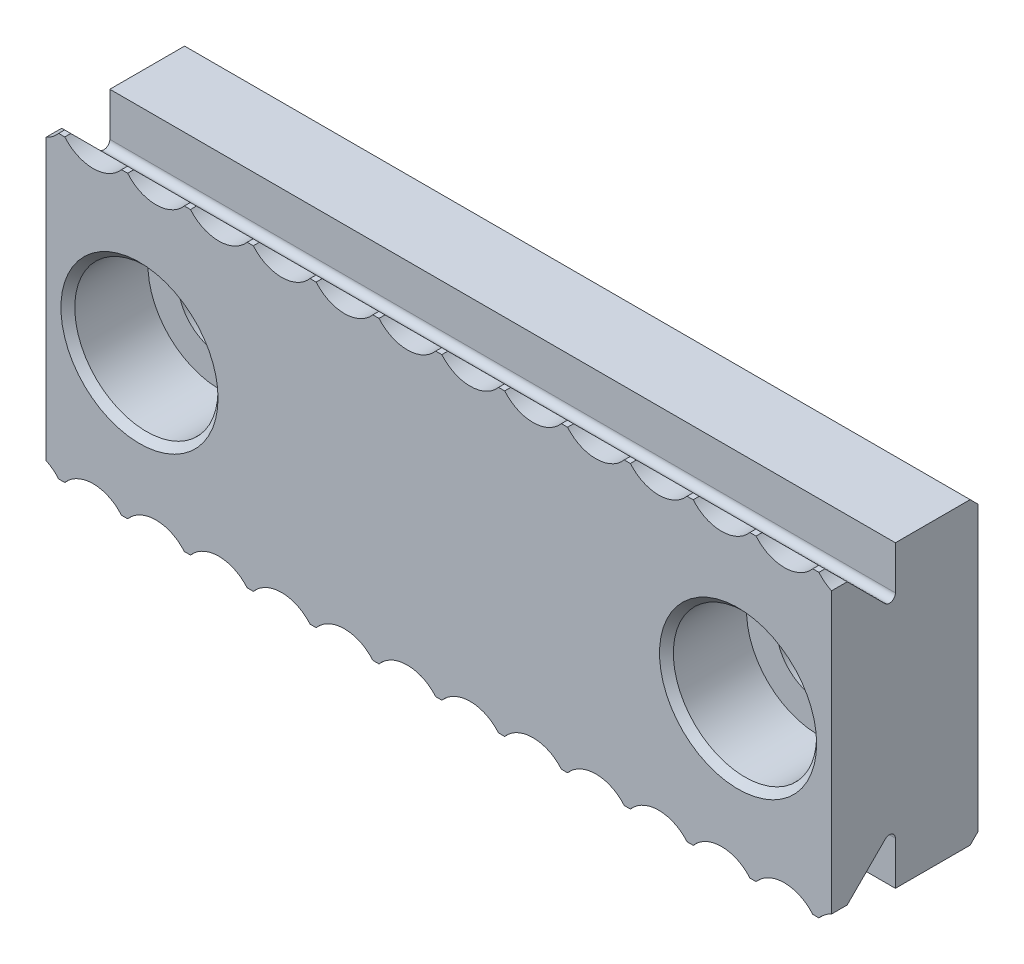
ISO-10303-21;
HEADER;
FILE_DESCRIPTION(('STEP AP214'),'2;1');
FILE_NAME('part.step','',(''),(''),'','','');
FILE_SCHEMA(('AUTOMOTIVE_DESIGN { 1 0 10303 214 1 1 1 1 }'));
ENDSEC;
DATA;
#1=APPLICATION_CONTEXT('core data for automotive mechanical design processes');
#2=APPLICATION_PROTOCOL_DEFINITION('international standard','automotive_design',2000,#1);
#3=PRODUCT_CONTEXT('',#1,'mechanical');
#4=PRODUCT('Part','Part','',(#3));
#5=PRODUCT_RELATED_PRODUCT_CATEGORY('part','',(#4));
#6=PRODUCT_DEFINITION_FORMATION('','',#4);
#7=PRODUCT_DEFINITION_CONTEXT('part definition',#1,'design');
#8=PRODUCT_DEFINITION('design','',#6,#7);
#9=PRODUCT_DEFINITION_SHAPE('','',#8);
#10=(LENGTH_UNIT() NAMED_UNIT(*) SI_UNIT(.MILLI.,.METRE.));
#11=(NAMED_UNIT(*) PLANE_ANGLE_UNIT() SI_UNIT($,.RADIAN.));
#12=(NAMED_UNIT(*) SI_UNIT($,.STERADIAN.) SOLID_ANGLE_UNIT());
#13=UNCERTAINTY_MEASURE_WITH_UNIT(LENGTH_MEASURE(1.E-05),#10,'distance_accuracy_value','');
#14=(GEOMETRIC_REPRESENTATION_CONTEXT(3) GLOBAL_UNCERTAINTY_ASSIGNED_CONTEXT((#13)) GLOBAL_UNIT_ASSIGNED_CONTEXT((#10,
#11,#12)) REPRESENTATION_CONTEXT('',''));
#15=CARTESIAN_POINT('',(0.,0.,0.));
#16=DIRECTION('',(0.,0.,1.));
#17=DIRECTION('',(1.,0.,0.));
#18=AXIS2_PLACEMENT_3D('',#15,#16,#17);
#19=CARTESIAN_POINT('',(-19.05,0.,4.064));
#20=DIRECTION('',(0.,0.,1.));
#21=DIRECTION('',(1.,0.,0.));
#22=AXIS2_PLACEMENT_3D('',#19,#20,#21);
#23=CYLINDRICAL_SURFACE('',#22,4.5593);
#24=CARTESIAN_POINT('',(-19.05,0.,-1.036));
#25=DIRECTION('',(0.,0.,1.));
#26=DIRECTION('',(1.,0.,0.));
#27=AXIS2_PLACEMENT_3D('',#24,#25,#26);
#28=CIRCLE('',#27,4.5593);
#29=CARTESIAN_POINT('',(-14.4907,0.,-1.036));
#30=VERTEX_POINT('',#29);
#31=EDGE_CURVE('E776',#30,#30,#28,.F.);
#32=ORIENTED_EDGE('',*,*,#31,.T.);
#33=EDGE_LOOP('',(#32));
#34=FACE_BOUND('',#33,.T.);
#35=CARTESIAN_POINT('',(-19.05,0.,3.6233000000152));
#36=DIRECTION('',(0.,0.,1.));
#37=DIRECTION('',(1.,0.,0.));
#38=AXIS2_PLACEMENT_3D('',#35,#36,#37);
#39=CIRCLE('',#38,4.55929999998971);
#40=CARTESIAN_POINT('',(-14.4907000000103,0.,3.6233000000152));
#41=VERTEX_POINT('',#40);
#42=EDGE_CURVE('E877',#41,#41,#39,.T.);
#43=ORIENTED_EDGE('',*,*,#42,.T.);
#44=EDGE_LOOP('',(#43));
#45=FACE_BOUND('',#44,.T.);
#46=ADVANCED_FACE('F14',(#34,#45),#23,.F.);
#47=CARTESIAN_POINT('',(19.05,0.,4.064));
#48=DIRECTION('',(0.,0.,1.));
#49=DIRECTION('',(1.,0.,0.));
#50=AXIS2_PLACEMENT_3D('',#47,#48,#49);
#51=CYLINDRICAL_SURFACE('',#50,4.5593);
#52=CARTESIAN_POINT('',(19.05,0.,-1.036));
#53=DIRECTION('',(0.,0.,1.));
#54=DIRECTION('',(1.,0.,0.));
#55=AXIS2_PLACEMENT_3D('',#52,#53,#54);
#56=CIRCLE('',#55,4.5593);
#57=CARTESIAN_POINT('',(23.6093,0.,-1.036));
#58=VERTEX_POINT('',#57);
#59=EDGE_CURVE('E757',#58,#58,#56,.F.);
#60=ORIENTED_EDGE('',*,*,#59,.T.);
#61=EDGE_LOOP('',(#60));
#62=FACE_BOUND('',#61,.T.);
#63=CARTESIAN_POINT('',(19.05,0.,3.6233000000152));
#64=DIRECTION('',(0.,0.,1.));
#65=DIRECTION('',(1.,0.,0.));
#66=AXIS2_PLACEMENT_3D('',#63,#64,#65);
#67=CIRCLE('',#66,4.55929999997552);
#68=CARTESIAN_POINT('',(23.6092999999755,0.,3.6233000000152));
#69=VERTEX_POINT('',#68);
#70=EDGE_CURVE('E874',#69,#69,#67,.T.);
#71=ORIENTED_EDGE('',*,*,#70,.T.);
#72=EDGE_LOOP('',(#71));
#73=FACE_BOUND('',#72,.T.);
#74=ADVANCED_FACE('F1274',(#62,#73),#51,.F.);
#75=CARTESIAN_POINT('',(-25.,-6.76181536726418,0.381));
#76=DIRECTION('',(-1.,0.,0.));
#77=DIRECTION('',(0.,0.,1.));
#78=AXIS2_PLACEMENT_3D('',#75,#76,#77);
#79=CYLINDRICAL_SURFACE('',#78,0.381);
#80=DIRECTION('',(-1.,0.,0.));
#81=VECTOR('',#80,1.);
#82=CARTESIAN_POINT('',(-25.,-6.76181536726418,0.));
#83=LINE('',#82,#81);
#84=CARTESIAN_POINT('',(-25.,-6.76181536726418,0.));
#85=VERTEX_POINT('',#84);
#86=CARTESIAN_POINT('',(25.,-6.76181536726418,0.));
#87=VERTEX_POINT('',#86);
#88=EDGE_CURVE('E434',#85,#87,#83,.F.);
#89=ORIENTED_EDGE('',*,*,#88,.T.);
#90=CARTESIAN_POINT('',(25.,-6.76181536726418,0.381));
#91=DIRECTION('',(-1.,0.,0.));
#92=DIRECTION('',(0.,0.,1.));
#93=AXIS2_PLACEMENT_3D('',#90,#91,#92);
#94=CIRCLE('',#93,0.381);
#95=CARTESIAN_POINT('',(25.,-6.49240768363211,0.650407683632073));
#96=VERTEX_POINT('',#95);
#97=EDGE_CURVE('E17',#96,#87,#94,.T.);
#98=ORIENTED_EDGE('',*,*,#97,.F.);
#99=DIRECTION('',(1.,0.,0.));
#100=VECTOR('',#99,1.);
#101=CARTESIAN_POINT('',(-25.,-6.49240768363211,0.650407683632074));
#102=LINE('',#101,#100);
#103=CARTESIAN_POINT('',(-25.,-6.49240768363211,0.650407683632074));
#104=VERTEX_POINT('',#103);
#105=EDGE_CURVE('E742',#96,#104,#102,.F.);
#106=ORIENTED_EDGE('',*,*,#105,.T.);
#107=CARTESIAN_POINT('',(-25.,-6.76181536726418,0.381));
#108=DIRECTION('',(-1.,0.,0.));
#109=DIRECTION('',(0.,0.,1.));
#110=AXIS2_PLACEMENT_3D('',#107,#108,#109);
#111=CIRCLE('',#110,0.381);
#112=EDGE_CURVE('E432',#85,#104,#111,.F.);
#113=ORIENTED_EDGE('',*,*,#112,.F.);
#114=EDGE_LOOP('',(#89,#98,#106,#113));
#115=FACE_BOUND('',#114,.T.);
#116=ADVANCED_FACE('F435',(#115),#79,.F.);
#117=CARTESIAN_POINT('',(-25.,6.76181536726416,0.381));
#118=DIRECTION('',(-1.,0.,0.));
#119=DIRECTION('',(0.,0.,1.));
#120=AXIS2_PLACEMENT_3D('',#117,#118,#119);
#121=CYLINDRICAL_SURFACE('',#120,0.381);
#122=DIRECTION('',(1.,0.,0.));
#123=VECTOR('',#122,1.);
#124=CARTESIAN_POINT('',(-25.,6.49240768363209,0.650407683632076));
#125=LINE('',#124,#123);
#126=CARTESIAN_POINT('',(-25.,6.49240768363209,0.650407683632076));
#127=VERTEX_POINT('',#126);
#128=CARTESIAN_POINT('',(25.,6.49240768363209,0.650407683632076));
#129=VERTEX_POINT('',#128);
#130=EDGE_CURVE('E634',#127,#129,#125,.T.);
#131=ORIENTED_EDGE('',*,*,#130,.T.);
#132=CARTESIAN_POINT('',(25.,6.76181536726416,0.381));
#133=DIRECTION('',(-1.,0.,0.));
#134=DIRECTION('',(0.,0.,1.));
#135=AXIS2_PLACEMENT_3D('',#132,#133,#134);
#136=CIRCLE('',#135,0.381);
#137=CARTESIAN_POINT('',(25.,6.76181536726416,0.));
#138=VERTEX_POINT('',#137);
#139=EDGE_CURVE('E1010',#138,#129,#136,.T.);
#140=ORIENTED_EDGE('',*,*,#139,.F.);
#141=DIRECTION('',(1.,0.,0.));
#142=VECTOR('',#141,1.);
#143=CARTESIAN_POINT('',(-25.,6.76181536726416,0.));
#144=LINE('',#143,#142);
#145=CARTESIAN_POINT('',(-25.,6.76181536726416,0.));
#146=VERTEX_POINT('',#145);
#147=EDGE_CURVE('E654',#138,#146,#144,.F.);
#148=ORIENTED_EDGE('',*,*,#147,.T.);
#149=CARTESIAN_POINT('',(-25.,6.76181536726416,0.381));
#150=DIRECTION('',(-1.,0.,0.));
#151=DIRECTION('',(0.,0.,1.));
#152=AXIS2_PLACEMENT_3D('',#149,#150,#151);
#153=CIRCLE('',#152,0.381);
#154=EDGE_CURVE('E880',#127,#146,#153,.F.);
#155=ORIENTED_EDGE('',*,*,#154,.F.);
#156=EDGE_LOOP('',(#131,#140,#148,#155));
#157=FACE_BOUND('',#156,.T.);
#158=ADVANCED_FACE('F1044',(#157),#121,.F.);
#159=CARTESIAN_POINT('',(-19.05,0.,4.0639999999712));
#160=DIRECTION('',(0.,0.,1.));
#161=DIRECTION('',(1.,0.,0.));
#162=AXIS2_PLACEMENT_3D('',#159,#160,#161);
#163=CONICAL_SURFACE('',#162,5.00000000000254,0.78539816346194);
#164=ORIENTED_EDGE('',*,*,#42,.F.);
#165=EDGE_LOOP('',(#164));
#166=FACE_BOUND('',#165,.T.);
#167=CARTESIAN_POINT('',(-19.05,0.,4.06399999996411));
#168=DIRECTION('',(0.,0.,1.));
#169=DIRECTION('',(1.,0.,0.));
#170=AXIS2_PLACEMENT_3D('',#167,#168,#169);
#171=CIRCLE('',#170,4.99999999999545);
#172=CARTESIAN_POINT('',(-14.0500000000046,0.,4.06399999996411));
#173=VERTEX_POINT('',#172);
#174=EDGE_CURVE('E947',#173,#173,#171,.T.);
#175=ORIENTED_EDGE('',*,*,#174,.T.);
#176=EDGE_LOOP('',(#175));
#177=FACE_BOUND('',#176,.T.);
#178=ADVANCED_FACE('F1266',(#166,#177),#163,.F.);
#179=CARTESIAN_POINT('',(19.05,0.,4.06400000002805));
#180=DIRECTION('',(0.,0.,1.));
#181=DIRECTION('',(1.,0.,0.));
#182=AXIS2_PLACEMENT_3D('',#179,#180,#181);
#183=CONICAL_SURFACE('',#182,4.99999999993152,0.785398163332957);
#184=ORIENTED_EDGE('',*,*,#70,.F.);
#185=EDGE_LOOP('',(#184));
#186=FACE_BOUND('',#185,.T.);
#187=CARTESIAN_POINT('',(19.05,0.,4.06400000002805));
#188=DIRECTION('',(0.,0.,1.));
#189=DIRECTION('',(1.,0.,0.));
#190=AXIS2_PLACEMENT_3D('',#187,#188,#189);
#191=CIRCLE('',#190,4.99999999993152);
#192=CARTESIAN_POINT('',(24.0499999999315,0.,4.06400000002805));
#193=VERTEX_POINT('',#192);
#194=EDGE_CURVE('E944',#193,#193,#191,.T.);
#195=ORIENTED_EDGE('',*,*,#194,.T.);
#196=EDGE_LOOP('',(#195));
#197=FACE_BOUND('',#196,.T.);
#198=ADVANCED_FACE('F1262',(#186,#197),#183,.F.);
#199=CARTESIAN_POINT('',(-2.,-11.049,-1.20927854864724));
#200=DIRECTION('',(0.,0.,1.));
#201=DIRECTION('',(1.,0.,0.));
#202=AXIS2_PLACEMENT_3D('',#199,#200,#201);
#203=CYLINDRICAL_SURFACE('',#202,2.3622);
#204=DIRECTION('',(0.,0.,1.));
#205=VECTOR('',#204,1.);
#206=CARTESIAN_POINT('',(-0.195169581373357,-9.525,3.683));
#207=LINE('',#206,#205);
#208=CARTESIAN_POINT('',(-0.195169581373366,-9.525,3.683));
#209=VERTEX_POINT('',#208);
#210=CARTESIAN_POINT('',(-0.195169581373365,-9.525,4.064));
#211=VERTEX_POINT('',#210);
#212=EDGE_CURVE('E777',#209,#211,#207,.T.);
#213=ORIENTED_EDGE('',*,*,#212,.T.);
#214=CARTESIAN_POINT('',(-2.,-11.049,4.064));
#215=DIRECTION('',(0.,0.,1.));
#216=DIRECTION('',(1.,0.,0.));
#217=AXIS2_PLACEMENT_3D('',#214,#215,#216);
#218=CIRCLE('',#217,2.3622);
#219=CARTESIAN_POINT('',(-3.80483041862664,-9.525,4.064));
#220=VERTEX_POINT('',#219);
#221=EDGE_CURVE('E586',#211,#220,#218,.T.);
#222=ORIENTED_EDGE('',*,*,#221,.T.);
#223=DIRECTION('',(0.,0.,1.));
#224=VECTOR('',#223,1.);
#225=CARTESIAN_POINT('',(-3.80483041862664,-9.525,3.683));
#226=LINE('',#225,#224);
#227=CARTESIAN_POINT('',(-3.80483041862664,-9.525,3.683));
#228=VERTEX_POINT('',#227);
#229=EDGE_CURVE('E872',#220,#228,#226,.F.);
#230=ORIENTED_EDGE('',*,*,#229,.T.);
#231=CARTESIAN_POINT('',(-2.,-11.049,5.207));
#232=DIRECTION('',(0.,0.707106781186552,0.707106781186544));
#233=DIRECTION('',(0.,-0.707106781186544,0.707106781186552));
#234=AXIS2_PLACEMENT_3D('',#231,#232,#233);
#235=ELLIPSE('',#234,3.34065527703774,2.3622);
#236=EDGE_CURVE('E696',#228,#209,#235,.F.);
#237=ORIENTED_EDGE('',*,*,#236,.T.);
#238=EDGE_LOOP('',(#213,#222,#230,#237));
#239=FACE_BOUND('',#238,.T.);
#240=ADVANCED_FACE('F1258',(#239),#203,.F.);
#241=CARTESIAN_POINT('',(-25.,-9.525,3.683));
#242=DIRECTION('',(0.,1.,0.));
#243=DIRECTION('',(0.,0.,1.));
#244=AXIS2_PLACEMENT_3D('',#241,#242,#243);
#245=PLANE('',#244);
#246=DIRECTION('',(0.,0.,1.));
#247=VECTOR('',#246,1.);
#248=CARTESIAN_POINT('',(-4.19516958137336,-9.525,-1.20927854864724));
#249=LINE('',#248,#247);
#250=CARTESIAN_POINT('',(-4.19516958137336,-9.525,4.064));
#251=VERTEX_POINT('',#250);
#252=CARTESIAN_POINT('',(-4.19516958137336,-9.525,3.683));
#253=VERTEX_POINT('',#252);
#254=EDGE_CURVE('E870',#251,#253,#249,.F.);
#255=ORIENTED_EDGE('',*,*,#254,.T.);
#256=DIRECTION('',(1.,0.,0.));
#257=VECTOR('',#256,1.);
#258=CARTESIAN_POINT('',(-25.,-9.525,3.683));
#259=LINE('',#258,#257);
#260=EDGE_CURVE('E697',#253,#228,#259,.T.);
#261=ORIENTED_EDGE('',*,*,#260,.T.);
#262=ORIENTED_EDGE('',*,*,#229,.F.);
#263=DIRECTION('',(1.,0.,0.));
#264=VECTOR('',#263,1.);
#265=CARTESIAN_POINT('',(-25.,-9.525,4.064));
#266=LINE('',#265,#264);
#267=EDGE_CURVE('E583',#220,#251,#266,.F.);
#268=ORIENTED_EDGE('',*,*,#267,.T.);
#269=EDGE_LOOP('',(#255,#261,#262,#268));
#270=FACE_BOUND('',#269,.T.);
#271=ADVANCED_FACE('F1254',(#270),#245,.F.);
#272=CARTESIAN_POINT('',(-6.,-11.049,-1.20927854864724));
#273=DIRECTION('',(0.,0.,1.));
#274=DIRECTION('',(1.,0.,0.));
#275=AXIS2_PLACEMENT_3D('',#272,#273,#274);
#276=CYLINDRICAL_SURFACE('',#275,2.3622);
#277=ORIENTED_EDGE('',*,*,#254,.F.);
#278=CARTESIAN_POINT('',(-6.,-11.049,4.064));
#279=DIRECTION('',(0.,0.,1.));
#280=DIRECTION('',(1.,0.,0.));
#281=AXIS2_PLACEMENT_3D('',#278,#279,#280);
#282=CIRCLE('',#281,2.3622);
#283=CARTESIAN_POINT('',(-7.80483041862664,-9.525,4.064));
#284=VERTEX_POINT('',#283);
#285=EDGE_CURVE('E582',#251,#284,#282,.T.);
#286=ORIENTED_EDGE('',*,*,#285,.T.);
#287=DIRECTION('',(0.,0.,1.));
#288=VECTOR('',#287,1.);
#289=CARTESIAN_POINT('',(-7.80483041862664,-9.525,3.683));
#290=LINE('',#289,#288);
#291=CARTESIAN_POINT('',(-7.80483041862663,-9.525,3.683));
#292=VERTEX_POINT('',#291);
#293=EDGE_CURVE('E868',#284,#292,#290,.F.);
#294=ORIENTED_EDGE('',*,*,#293,.T.);
#295=CARTESIAN_POINT('',(-6.,-11.049,5.207));
#296=DIRECTION('',(0.,0.707106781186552,0.707106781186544));
#297=DIRECTION('',(0.,-0.707106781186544,0.707106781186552));
#298=AXIS2_PLACEMENT_3D('',#295,#296,#297);
#299=ELLIPSE('',#298,3.34065527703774,2.3622);
#300=EDGE_CURVE('E700',#292,#253,#299,.F.);
#301=ORIENTED_EDGE('',*,*,#300,.T.);
#302=EDGE_LOOP('',(#277,#286,#294,#301));
#303=FACE_BOUND('',#302,.T.);
#304=ADVANCED_FACE('F1250',(#303),#276,.F.);
#305=CARTESIAN_POINT('',(-25.,-9.525,3.683));
#306=DIRECTION('',(0.,1.,0.));
#307=DIRECTION('',(0.,0.,1.));
#308=AXIS2_PLACEMENT_3D('',#305,#306,#307);
#309=PLANE('',#308);
#310=ORIENTED_EDGE('',*,*,#293,.F.);
#311=DIRECTION('',(1.,0.,0.));
#312=VECTOR('',#311,1.);
#313=CARTESIAN_POINT('',(-25.,-9.525,4.064));
#314=LINE('',#313,#312);
#315=CARTESIAN_POINT('',(-8.19516958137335,-9.525,4.064));
#316=VERTEX_POINT('',#315);
#317=EDGE_CURVE('E579',#284,#316,#314,.F.);
#318=ORIENTED_EDGE('',*,*,#317,.T.);
#319=DIRECTION('',(0.,0.,1.));
#320=VECTOR('',#319,1.);
#321=CARTESIAN_POINT('',(-8.19516958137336,-9.525,-1.20927854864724));
#322=LINE('',#321,#320);
#323=CARTESIAN_POINT('',(-8.19516958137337,-9.525,3.683));
#324=VERTEX_POINT('',#323);
#325=EDGE_CURVE('E866',#316,#324,#322,.F.);
#326=ORIENTED_EDGE('',*,*,#325,.T.);
#327=DIRECTION('',(1.,0.,0.));
#328=VECTOR('',#327,1.);
#329=CARTESIAN_POINT('',(-25.,-9.525,3.683));
#330=LINE('',#329,#328);
#331=EDGE_CURVE('E701',#324,#292,#330,.T.);
#332=ORIENTED_EDGE('',*,*,#331,.T.);
#333=EDGE_LOOP('',(#310,#318,#326,#332));
#334=FACE_BOUND('',#333,.T.);
#335=ADVANCED_FACE('F1246',(#334),#309,.F.);
#336=CARTESIAN_POINT('',(-10.,-11.049,-1.20927854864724));
#337=DIRECTION('',(0.,0.,1.));
#338=DIRECTION('',(1.,0.,0.));
#339=AXIS2_PLACEMENT_3D('',#336,#337,#338);
#340=CYLINDRICAL_SURFACE('',#339,2.3622);
#341=ORIENTED_EDGE('',*,*,#325,.F.);
#342=CARTESIAN_POINT('',(-10.,-11.049,4.064));
#343=DIRECTION('',(0.,0.,1.));
#344=DIRECTION('',(1.,0.,0.));
#345=AXIS2_PLACEMENT_3D('',#342,#343,#344);
#346=CIRCLE('',#345,2.3622);
#347=CARTESIAN_POINT('',(-11.8048304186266,-9.525,4.064));
#348=VERTEX_POINT('',#347);
#349=EDGE_CURVE('E578',#316,#348,#346,.T.);
#350=ORIENTED_EDGE('',*,*,#349,.T.);
#351=DIRECTION('',(0.,0.,1.));
#352=VECTOR('',#351,1.);
#353=CARTESIAN_POINT('',(-11.8048304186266,-9.525,3.683));
#354=LINE('',#353,#352);
#355=CARTESIAN_POINT('',(-11.8048304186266,-9.525,3.683));
#356=VERTEX_POINT('',#355);
#357=EDGE_CURVE('E864',#348,#356,#354,.F.);
#358=ORIENTED_EDGE('',*,*,#357,.T.);
#359=CARTESIAN_POINT('',(-10.,-11.049,5.207));
#360=DIRECTION('',(0.,0.707106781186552,0.707106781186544));
#361=DIRECTION('',(0.,-0.707106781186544,0.707106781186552));
#362=AXIS2_PLACEMENT_3D('',#359,#360,#361);
#363=ELLIPSE('',#362,3.34065527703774,2.3622);
#364=EDGE_CURVE('E704',#356,#324,#363,.F.);
#365=ORIENTED_EDGE('',*,*,#364,.T.);
#366=EDGE_LOOP('',(#341,#350,#358,#365));
#367=FACE_BOUND('',#366,.T.);
#368=ADVANCED_FACE('F1242',(#367),#340,.F.);
#369=CARTESIAN_POINT('',(-25.,-9.525,3.683));
#370=DIRECTION('',(0.,1.,0.));
#371=DIRECTION('',(0.,0.,1.));
#372=AXIS2_PLACEMENT_3D('',#369,#370,#371);
#373=PLANE('',#372);
#374=ORIENTED_EDGE('',*,*,#357,.F.);
#375=DIRECTION('',(1.,0.,0.));
#376=VECTOR('',#375,1.);
#377=CARTESIAN_POINT('',(-25.,-9.525,4.064));
#378=LINE('',#377,#376);
#379=CARTESIAN_POINT('',(-12.1951695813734,-9.525,4.064));
#380=VERTEX_POINT('',#379);
#381=EDGE_CURVE('E575',#348,#380,#378,.F.);
#382=ORIENTED_EDGE('',*,*,#381,.T.);
#383=DIRECTION('',(0.,0.,1.));
#384=VECTOR('',#383,1.);
#385=CARTESIAN_POINT('',(-12.1951695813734,-9.525,-1.20927854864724));
#386=LINE('',#385,#384);
#387=CARTESIAN_POINT('',(-12.1951695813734,-9.525,3.683));
#388=VERTEX_POINT('',#387);
#389=EDGE_CURVE('E862',#380,#388,#386,.F.);
#390=ORIENTED_EDGE('',*,*,#389,.T.);
#391=DIRECTION('',(1.,0.,0.));
#392=VECTOR('',#391,1.);
#393=CARTESIAN_POINT('',(-25.,-9.525,3.683));
#394=LINE('',#393,#392);
#395=EDGE_CURVE('E705',#388,#356,#394,.T.);
#396=ORIENTED_EDGE('',*,*,#395,.T.);
#397=EDGE_LOOP('',(#374,#382,#390,#396));
#398=FACE_BOUND('',#397,.T.);
#399=ADVANCED_FACE('F1238',(#398),#373,.F.);
#400=CARTESIAN_POINT('',(-14.,-11.049,-1.20927854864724));
#401=DIRECTION('',(0.,0.,1.));
#402=DIRECTION('',(1.,0.,0.));
#403=AXIS2_PLACEMENT_3D('',#400,#401,#402);
#404=CYLINDRICAL_SURFACE('',#403,2.3622);
#405=ORIENTED_EDGE('',*,*,#389,.F.);
#406=CARTESIAN_POINT('',(-14.,-11.049,4.064));
#407=DIRECTION('',(0.,0.,1.));
#408=DIRECTION('',(1.,0.,0.));
#409=AXIS2_PLACEMENT_3D('',#406,#407,#408);
#410=CIRCLE('',#409,2.3622);
#411=CARTESIAN_POINT('',(-15.8048304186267,-9.525,4.064));
#412=VERTEX_POINT('',#411);
#413=EDGE_CURVE('E574',#380,#412,#410,.T.);
#414=ORIENTED_EDGE('',*,*,#413,.T.);
#415=DIRECTION('',(0.,0.,1.));
#416=VECTOR('',#415,1.);
#417=CARTESIAN_POINT('',(-15.8048304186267,-9.525,3.683));
#418=LINE('',#417,#416);
#419=CARTESIAN_POINT('',(-15.8048304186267,-9.525,3.683));
#420=VERTEX_POINT('',#419);
#421=EDGE_CURVE('E860',#412,#420,#418,.F.);
#422=ORIENTED_EDGE('',*,*,#421,.T.);
#423=CARTESIAN_POINT('',(-14.,-11.049,5.207));
#424=DIRECTION('',(0.,0.707106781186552,0.707106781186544));
#425=DIRECTION('',(0.,-0.707106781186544,0.707106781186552));
#426=AXIS2_PLACEMENT_3D('',#423,#424,#425);
#427=ELLIPSE('',#426,3.34065527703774,2.3622);
#428=EDGE_CURVE('E708',#420,#388,#427,.F.);
#429=ORIENTED_EDGE('',*,*,#428,.T.);
#430=EDGE_LOOP('',(#405,#414,#422,#429));
#431=FACE_BOUND('',#430,.T.);
#432=ADVANCED_FACE('F1234',(#431),#404,.F.);
#433=CARTESIAN_POINT('',(-25.,-9.525,3.683));
#434=DIRECTION('',(0.,1.,0.));
#435=DIRECTION('',(0.,0.,1.));
#436=AXIS2_PLACEMENT_3D('',#433,#434,#435);
#437=PLANE('',#436);
#438=ORIENTED_EDGE('',*,*,#421,.F.);
#439=DIRECTION('',(1.,0.,0.));
#440=VECTOR('',#439,1.);
#441=CARTESIAN_POINT('',(-25.,-9.525,4.064));
#442=LINE('',#441,#440);
#443=CARTESIAN_POINT('',(-16.1951695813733,-9.525,4.064));
#444=VERTEX_POINT('',#443);
#445=EDGE_CURVE('E571',#412,#444,#442,.F.);
#446=ORIENTED_EDGE('',*,*,#445,.T.);
#447=DIRECTION('',(0.,0.,1.));
#448=VECTOR('',#447,1.);
#449=CARTESIAN_POINT('',(-16.1951695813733,-9.525,-1.20927854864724));
#450=LINE('',#449,#448);
#451=CARTESIAN_POINT('',(-16.1951695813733,-9.525,3.683));
#452=VERTEX_POINT('',#451);
#453=EDGE_CURVE('E858',#444,#452,#450,.F.);
#454=ORIENTED_EDGE('',*,*,#453,.T.);
#455=DIRECTION('',(1.,0.,0.));
#456=VECTOR('',#455,1.);
#457=CARTESIAN_POINT('',(-25.,-9.525,3.683));
#458=LINE('',#457,#456);
#459=EDGE_CURVE('E709',#452,#420,#458,.T.);
#460=ORIENTED_EDGE('',*,*,#459,.T.);
#461=EDGE_LOOP('',(#438,#446,#454,#460));
#462=FACE_BOUND('',#461,.T.);
#463=ADVANCED_FACE('F1230',(#462),#437,.F.);
#464=CARTESIAN_POINT('',(-18.,-11.049,-1.20927854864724));
#465=DIRECTION('',(0.,0.,1.));
#466=DIRECTION('',(1.,0.,0.));
#467=AXIS2_PLACEMENT_3D('',#464,#465,#466);
#468=CYLINDRICAL_SURFACE('',#467,2.3622);
#469=ORIENTED_EDGE('',*,*,#453,.F.);
#470=CARTESIAN_POINT('',(-18.,-11.049,4.064));
#471=DIRECTION('',(0.,0.,1.));
#472=DIRECTION('',(1.,0.,0.));
#473=AXIS2_PLACEMENT_3D('',#470,#471,#472);
#474=CIRCLE('',#473,2.3622);
#475=CARTESIAN_POINT('',(-19.8048304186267,-9.525,4.064));
#476=VERTEX_POINT('',#475);
#477=EDGE_CURVE('E570',#444,#476,#474,.T.);
#478=ORIENTED_EDGE('',*,*,#477,.T.);
#479=DIRECTION('',(0.,0.,1.));
#480=VECTOR('',#479,1.);
#481=CARTESIAN_POINT('',(-19.8048304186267,-9.525,3.683));
#482=LINE('',#481,#480);
#483=CARTESIAN_POINT('',(-19.8048304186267,-9.525,3.683));
#484=VERTEX_POINT('',#483);
#485=EDGE_CURVE('E856',#476,#484,#482,.F.);
#486=ORIENTED_EDGE('',*,*,#485,.T.);
#487=CARTESIAN_POINT('',(-18.,-11.049,5.207));
#488=DIRECTION('',(0.,0.707106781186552,0.707106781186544));
#489=DIRECTION('',(0.,-0.707106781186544,0.707106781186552));
#490=AXIS2_PLACEMENT_3D('',#487,#488,#489);
#491=ELLIPSE('',#490,3.34065527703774,2.3622);
#492=EDGE_CURVE('E712',#484,#452,#491,.F.);
#493=ORIENTED_EDGE('',*,*,#492,.T.);
#494=EDGE_LOOP('',(#469,#478,#486,#493));
#495=FACE_BOUND('',#494,.T.);
#496=ADVANCED_FACE('F1226',(#495),#468,.F.);
#497=CARTESIAN_POINT('',(-25.,-9.525,3.683));
#498=DIRECTION('',(0.,1.,0.));
#499=DIRECTION('',(0.,0.,1.));
#500=AXIS2_PLACEMENT_3D('',#497,#498,#499);
#501=PLANE('',#500);
#502=ORIENTED_EDGE('',*,*,#485,.F.);
#503=DIRECTION('',(1.,0.,0.));
#504=VECTOR('',#503,1.);
#505=CARTESIAN_POINT('',(-25.,-9.525,4.064));
#506=LINE('',#505,#504);
#507=CARTESIAN_POINT('',(-20.1951695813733,-9.525,4.064));
#508=VERTEX_POINT('',#507);
#509=EDGE_CURVE('E567',#476,#508,#506,.F.);
#510=ORIENTED_EDGE('',*,*,#509,.T.);
#511=DIRECTION('',(0.,0.,1.));
#512=VECTOR('',#511,1.);
#513=CARTESIAN_POINT('',(-20.1951695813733,-9.525,-1.20927854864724));
#514=LINE('',#513,#512);
#515=CARTESIAN_POINT('',(-20.1951695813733,-9.525,3.683));
#516=VERTEX_POINT('',#515);
#517=EDGE_CURVE('E854',#508,#516,#514,.F.);
#518=ORIENTED_EDGE('',*,*,#517,.T.);
#519=DIRECTION('',(1.,0.,0.));
#520=VECTOR('',#519,1.);
#521=CARTESIAN_POINT('',(-25.,-9.525,3.683));
#522=LINE('',#521,#520);
#523=EDGE_CURVE('E713',#516,#484,#522,.T.);
#524=ORIENTED_EDGE('',*,*,#523,.T.);
#525=EDGE_LOOP('',(#502,#510,#518,#524));
#526=FACE_BOUND('',#525,.T.);
#527=ADVANCED_FACE('F1222',(#526),#501,.F.);
#528=CARTESIAN_POINT('',(-22.,-11.049,-1.20927854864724));
#529=DIRECTION('',(0.,0.,1.));
#530=DIRECTION('',(1.,0.,0.));
#531=AXIS2_PLACEMENT_3D('',#528,#529,#530);
#532=CYLINDRICAL_SURFACE('',#531,2.3622);
#533=ORIENTED_EDGE('',*,*,#517,.F.);
#534=CARTESIAN_POINT('',(-22.,-11.049,4.064));
#535=DIRECTION('',(0.,0.,1.));
#536=DIRECTION('',(1.,0.,0.));
#537=AXIS2_PLACEMENT_3D('',#534,#535,#536);
#538=CIRCLE('',#537,2.3622);
#539=CARTESIAN_POINT('',(-23.8048304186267,-9.525,4.064));
#540=VERTEX_POINT('',#539);
#541=EDGE_CURVE('E566',#508,#540,#538,.T.);
#542=ORIENTED_EDGE('',*,*,#541,.T.);
#543=DIRECTION('',(0.,0.,1.));
#544=VECTOR('',#543,1.);
#545=CARTESIAN_POINT('',(-23.8048304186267,-9.525,3.683));
#546=LINE('',#545,#544);
#547=CARTESIAN_POINT('',(-23.8048304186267,-9.525,3.683));
#548=VERTEX_POINT('',#547);
#549=EDGE_CURVE('E852',#540,#548,#546,.F.);
#550=ORIENTED_EDGE('',*,*,#549,.T.);
#551=CARTESIAN_POINT('',(-22.,-11.049,5.207));
#552=DIRECTION('',(0.,0.707106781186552,0.707106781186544));
#553=DIRECTION('',(0.,-0.707106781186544,0.707106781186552));
#554=AXIS2_PLACEMENT_3D('',#551,#552,#553);
#555=ELLIPSE('',#554,3.34065527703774,2.3622);
#556=EDGE_CURVE('E716',#548,#516,#555,.F.);
#557=ORIENTED_EDGE('',*,*,#556,.T.);
#558=EDGE_LOOP('',(#533,#542,#550,#557));
#559=FACE_BOUND('',#558,.T.);
#560=ADVANCED_FACE('F1215',(#559),#532,.F.);
#561=CARTESIAN_POINT('',(-25.,-9.525,3.683));
#562=DIRECTION('',(0.,1.,0.));
#563=DIRECTION('',(0.,0.,1.));
#564=AXIS2_PLACEMENT_3D('',#561,#562,#563);
#565=PLANE('',#564);
#566=ORIENTED_EDGE('',*,*,#549,.F.);
#567=DIRECTION('',(1.,0.,0.));
#568=VECTOR('',#567,1.);
#569=CARTESIAN_POINT('',(-25.,-9.525,4.064));
#570=LINE('',#569,#568);
#571=CARTESIAN_POINT('',(-24.1951695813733,-9.525,4.064));
#572=VERTEX_POINT('',#571);
#573=EDGE_CURVE('E562',#540,#572,#570,.F.);
#574=ORIENTED_EDGE('',*,*,#573,.T.);
#575=DIRECTION('',(0.,0.,1.));
#576=VECTOR('',#575,1.);
#577=CARTESIAN_POINT('',(-24.1951695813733,-9.525,-1.20927854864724));
#578=LINE('',#577,#576);
#579=CARTESIAN_POINT('',(-24.1951695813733,-9.525,3.683));
#580=VERTEX_POINT('',#579);
#581=EDGE_CURVE('E746',#572,#580,#578,.F.);
#582=ORIENTED_EDGE('',*,*,#581,.T.);
#583=DIRECTION('',(1.,0.,0.));
#584=VECTOR('',#583,1.);
#585=CARTESIAN_POINT('',(-25.,-9.525,3.683));
#586=LINE('',#585,#584);
#587=EDGE_CURVE('E717',#580,#548,#586,.T.);
#588=ORIENTED_EDGE('',*,*,#587,.T.);
#589=EDGE_LOOP('',(#566,#574,#582,#588));
#590=FACE_BOUND('',#589,.T.);
#591=ADVANCED_FACE('F1208',(#590),#565,.F.);
#592=CARTESIAN_POINT('',(-25.,9.525,4.064));
#593=DIRECTION('',(0.,-1.,0.));
#594=DIRECTION('',(0.,0.,-1.));
#595=AXIS2_PLACEMENT_3D('',#592,#593,#594);
#596=PLANE('',#595);
#597=DIRECTION('',(0.,0.,1.));
#598=VECTOR('',#597,1.);
#599=CARTESIAN_POINT('',(-24.1951695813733,9.525,-1.20927854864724));
#600=LINE('',#599,#598);
#601=CARTESIAN_POINT('',(-24.1951695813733,9.525,3.683));
#602=VERTEX_POINT('',#601);
#603=CARTESIAN_POINT('',(-24.1951695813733,9.525,4.064));
#604=VERTEX_POINT('',#603);
#605=EDGE_CURVE('E751',#602,#604,#600,.T.);
#606=ORIENTED_EDGE('',*,*,#605,.T.);
#607=DIRECTION('',(1.,0.,0.));
#608=VECTOR('',#607,1.);
#609=CARTESIAN_POINT('',(-25.,9.525,4.064));
#610=LINE('',#609,#608);
#611=CARTESIAN_POINT('',(-23.8048304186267,9.525,4.064));
#612=VERTEX_POINT('',#611);
#613=EDGE_CURVE('E558',#604,#612,#610,.T.);
#614=ORIENTED_EDGE('',*,*,#613,.T.);
#615=DIRECTION('',(0.,0.,1.));
#616=VECTOR('',#615,1.);
#617=CARTESIAN_POINT('',(-23.8048304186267,9.525,-1.20927854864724));
#618=LINE('',#617,#616);
#619=CARTESIAN_POINT('',(-23.8048304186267,9.525,3.683));
#620=VERTEX_POINT('',#619);
#621=EDGE_CURVE('E850',#612,#620,#618,.F.);
#622=ORIENTED_EDGE('',*,*,#621,.T.);
#623=DIRECTION('',(1.,0.,0.));
#624=VECTOR('',#623,1.);
#625=CARTESIAN_POINT('',(-25.,9.525,3.68299999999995));
#626=LINE('',#625,#624);
#627=EDGE_CURVE('E635',#620,#602,#626,.F.);
#628=ORIENTED_EDGE('',*,*,#627,.T.);
#629=EDGE_LOOP('',(#606,#614,#622,#628));
#630=FACE_BOUND('',#629,.T.);
#631=ADVANCED_FACE('F1206',(#630),#596,.F.);
#632=CARTESIAN_POINT('',(-22.,11.049,-1.20927854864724));
#633=DIRECTION('',(0.,0.,1.));
#634=DIRECTION('',(1.,0.,0.));
#635=AXIS2_PLACEMENT_3D('',#632,#633,#634);
#636=CYLINDRICAL_SURFACE('',#635,2.3622);
#637=ORIENTED_EDGE('',*,*,#621,.F.);
#638=CARTESIAN_POINT('',(-22.,11.049,4.064));
#639=DIRECTION('',(0.,0.,1.));
#640=DIRECTION('',(1.,0.,0.));
#641=AXIS2_PLACEMENT_3D('',#638,#639,#640);
#642=CIRCLE('',#641,2.3622);
#643=CARTESIAN_POINT('',(-20.1951695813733,9.525,4.064));
#644=VERTEX_POINT('',#643);
#645=EDGE_CURVE('E557',#612,#644,#642,.T.);
#646=ORIENTED_EDGE('',*,*,#645,.T.);
#647=DIRECTION('',(0.,0.,-1.));
#648=VECTOR('',#647,1.);
#649=CARTESIAN_POINT('',(-20.1951695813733,9.525,4.064));
#650=LINE('',#649,#648);
#651=CARTESIAN_POINT('',(-20.1951695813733,9.525,3.683));
#652=VERTEX_POINT('',#651);
#653=EDGE_CURVE('E848',#644,#652,#650,.T.);
#654=ORIENTED_EDGE('',*,*,#653,.T.);
#655=CARTESIAN_POINT('',(-22.,11.049,5.20699999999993));
#656=DIRECTION('',(0.,-0.707106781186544,0.707106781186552));
#657=DIRECTION('',(0.,0.707106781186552,0.707106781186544));
#658=AXIS2_PLACEMENT_3D('',#655,#656,#657);
#659=ELLIPSE('',#658,3.34065527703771,2.3622);
#660=EDGE_CURVE('E639',#652,#620,#659,.F.);
#661=ORIENTED_EDGE('',*,*,#660,.T.);
#662=EDGE_LOOP('',(#637,#646,#654,#661));
#663=FACE_BOUND('',#662,.T.);
#664=ADVANCED_FACE('F1204',(#663),#636,.F.);
#665=CARTESIAN_POINT('',(-25.,9.525,4.064));
#666=DIRECTION('',(0.,-1.,0.));
#667=DIRECTION('',(0.,0.,-1.));
#668=AXIS2_PLACEMENT_3D('',#665,#666,#667);
#669=PLANE('',#668);
#670=ORIENTED_EDGE('',*,*,#653,.F.);
#671=DIRECTION('',(1.,0.,0.));
#672=VECTOR('',#671,1.);
#673=CARTESIAN_POINT('',(-25.,9.525,4.064));
#674=LINE('',#673,#672);
#675=CARTESIAN_POINT('',(-19.8048304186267,9.525,4.064));
#676=VERTEX_POINT('',#675);
#677=EDGE_CURVE('E554',#644,#676,#674,.T.);
#678=ORIENTED_EDGE('',*,*,#677,.T.);
#679=DIRECTION('',(0.,0.,1.));
#680=VECTOR('',#679,1.);
#681=CARTESIAN_POINT('',(-19.8048304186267,9.525,-1.20927854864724));
#682=LINE('',#681,#680);
#683=CARTESIAN_POINT('',(-19.8048304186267,9.525,3.68299999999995));
#684=VERTEX_POINT('',#683);
#685=EDGE_CURVE('E846',#676,#684,#682,.F.);
#686=ORIENTED_EDGE('',*,*,#685,.T.);
#687=DIRECTION('',(1.,0.,0.));
#688=VECTOR('',#687,1.);
#689=CARTESIAN_POINT('',(-25.,9.525,3.68299999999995));
#690=LINE('',#689,#688);
#691=EDGE_CURVE('E640',#684,#652,#690,.F.);
#692=ORIENTED_EDGE('',*,*,#691,.T.);
#693=EDGE_LOOP('',(#670,#678,#686,#692));
#694=FACE_BOUND('',#693,.T.);
#695=ADVANCED_FACE('F1201',(#694),#669,.F.);
#696=CARTESIAN_POINT('',(-18.,11.049,-1.20927854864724));
#697=DIRECTION('',(0.,0.,1.));
#698=DIRECTION('',(1.,0.,0.));
#699=AXIS2_PLACEMENT_3D('',#696,#697,#698);
#700=CYLINDRICAL_SURFACE('',#699,2.3622);
#701=ORIENTED_EDGE('',*,*,#685,.F.);
#702=CARTESIAN_POINT('',(-18.,11.049,4.064));
#703=DIRECTION('',(0.,0.,1.));
#704=DIRECTION('',(1.,0.,0.));
#705=AXIS2_PLACEMENT_3D('',#702,#703,#704);
#706=CIRCLE('',#705,2.3622);
#707=CARTESIAN_POINT('',(-16.1951695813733,9.525,4.064));
#708=VERTEX_POINT('',#707);
#709=EDGE_CURVE('E553',#676,#708,#706,.T.);
#710=ORIENTED_EDGE('',*,*,#709,.T.);
#711=DIRECTION('',(0.,0.,-1.));
#712=VECTOR('',#711,1.);
#713=CARTESIAN_POINT('',(-16.1951695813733,9.525,4.064));
#714=LINE('',#713,#712);
#715=CARTESIAN_POINT('',(-16.1951695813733,9.525,3.683));
#716=VERTEX_POINT('',#715);
#717=EDGE_CURVE('E844',#708,#716,#714,.T.);
#718=ORIENTED_EDGE('',*,*,#717,.T.);
#719=CARTESIAN_POINT('',(-18.,11.049,5.20699999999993));
#720=DIRECTION('',(0.,-0.707106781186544,0.707106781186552));
#721=DIRECTION('',(0.,0.707106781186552,0.707106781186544));
#722=AXIS2_PLACEMENT_3D('',#719,#720,#721);
#723=ELLIPSE('',#722,3.34065527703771,2.3622);
#724=EDGE_CURVE('E643',#716,#684,#723,.F.);
#725=ORIENTED_EDGE('',*,*,#724,.T.);
#726=EDGE_LOOP('',(#701,#710,#718,#725));
#727=FACE_BOUND('',#726,.T.);
#728=ADVANCED_FACE('F1199',(#727),#700,.F.);
#729=CARTESIAN_POINT('',(-25.,9.525,4.064));
#730=DIRECTION('',(0.,-1.,0.));
#731=DIRECTION('',(0.,0.,-1.));
#732=AXIS2_PLACEMENT_3D('',#729,#730,#731);
#733=PLANE('',#732);
#734=DIRECTION('',(0.,0.,1.));
#735=VECTOR('',#734,1.);
#736=CARTESIAN_POINT('',(-15.8048304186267,9.525,-1.20927854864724));
#737=LINE('',#736,#735);
#738=CARTESIAN_POINT('',(-15.8048304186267,9.525,4.064));
#739=VERTEX_POINT('',#738);
#740=CARTESIAN_POINT('',(-15.8048304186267,9.525,3.683));
#741=VERTEX_POINT('',#740);
#742=EDGE_CURVE('E842',#739,#741,#737,.F.);
#743=ORIENTED_EDGE('',*,*,#742,.T.);
#744=DIRECTION('',(1.,0.,0.));
#745=VECTOR('',#744,1.);
#746=CARTESIAN_POINT('',(-25.,9.525,3.68299999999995));
#747=LINE('',#746,#745);
#748=EDGE_CURVE('E644',#741,#716,#747,.F.);
#749=ORIENTED_EDGE('',*,*,#748,.T.);
#750=ORIENTED_EDGE('',*,*,#717,.F.);
#751=DIRECTION('',(1.,0.,0.));
#752=VECTOR('',#751,1.);
#753=CARTESIAN_POINT('',(-25.,9.525,4.064));
#754=LINE('',#753,#752);
#755=EDGE_CURVE('E550',#708,#739,#754,.T.);
#756=ORIENTED_EDGE('',*,*,#755,.T.);
#757=EDGE_LOOP('',(#743,#749,#750,#756));
#758=FACE_BOUND('',#757,.T.);
#759=ADVANCED_FACE('F1194',(#758),#733,.F.);
#760=CARTESIAN_POINT('',(-14.,11.049,-1.20927854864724));
#761=DIRECTION('',(0.,0.,1.));
#762=DIRECTION('',(1.,0.,0.));
#763=AXIS2_PLACEMENT_3D('',#760,#761,#762);
#764=CYLINDRICAL_SURFACE('',#763,2.3622);
#765=ORIENTED_EDGE('',*,*,#742,.F.);
#766=CARTESIAN_POINT('',(-14.,11.049,4.064));
#767=DIRECTION('',(0.,0.,1.));
#768=DIRECTION('',(1.,0.,0.));
#769=AXIS2_PLACEMENT_3D('',#766,#767,#768);
#770=CIRCLE('',#769,2.3622);
#771=CARTESIAN_POINT('',(-12.1951695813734,9.525,4.064));
#772=VERTEX_POINT('',#771);
#773=EDGE_CURVE('E549',#739,#772,#770,.T.);
#774=ORIENTED_EDGE('',*,*,#773,.T.);
#775=DIRECTION('',(0.,0.,-1.));
#776=VECTOR('',#775,1.);
#777=CARTESIAN_POINT('',(-12.1951695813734,9.525,4.064));
#778=LINE('',#777,#776);
#779=CARTESIAN_POINT('',(-12.1951695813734,9.525,3.68299999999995));
#780=VERTEX_POINT('',#779);
#781=EDGE_CURVE('E840',#772,#780,#778,.T.);
#782=ORIENTED_EDGE('',*,*,#781,.T.);
#783=CARTESIAN_POINT('',(-14.,11.049,5.20699999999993));
#784=DIRECTION('',(0.,-0.707106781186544,0.707106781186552));
#785=DIRECTION('',(0.,0.707106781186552,0.707106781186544));
#786=AXIS2_PLACEMENT_3D('',#783,#784,#785);
#787=ELLIPSE('',#786,3.34065527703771,2.3622);
#788=EDGE_CURVE('E647',#780,#741,#787,.F.);
#789=ORIENTED_EDGE('',*,*,#788,.T.);
#790=EDGE_LOOP('',(#765,#774,#782,#789));
#791=FACE_BOUND('',#790,.T.);
#792=ADVANCED_FACE('F1189',(#791),#764,.F.);
#793=CARTESIAN_POINT('',(-25.,9.525,4.064));
#794=DIRECTION('',(0.,-1.,0.));
#795=DIRECTION('',(0.,0.,-1.));
#796=AXIS2_PLACEMENT_3D('',#793,#794,#795);
#797=PLANE('',#796);
#798=ORIENTED_EDGE('',*,*,#781,.F.);
#799=DIRECTION('',(1.,0.,0.));
#800=VECTOR('',#799,1.);
#801=CARTESIAN_POINT('',(-25.,9.525,4.064));
#802=LINE('',#801,#800);
#803=CARTESIAN_POINT('',(-11.8048304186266,9.525,4.064));
#804=VERTEX_POINT('',#803);
#805=EDGE_CURVE('E546',#772,#804,#802,.T.);
#806=ORIENTED_EDGE('',*,*,#805,.T.);
#807=DIRECTION('',(0.,0.,1.));
#808=VECTOR('',#807,1.);
#809=CARTESIAN_POINT('',(-11.8048304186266,9.525,-1.20927854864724));
#810=LINE('',#809,#808);
#811=CARTESIAN_POINT('',(-11.8048304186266,9.525,3.68299999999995));
#812=VERTEX_POINT('',#811);
#813=EDGE_CURVE('E838',#804,#812,#810,.F.);
#814=ORIENTED_EDGE('',*,*,#813,.T.);
#815=DIRECTION('',(1.,0.,0.));
#816=VECTOR('',#815,1.);
#817=CARTESIAN_POINT('',(-25.,9.525,3.68299999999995));
#818=LINE('',#817,#816);
#819=EDGE_CURVE('E648',#812,#780,#818,.F.);
#820=ORIENTED_EDGE('',*,*,#819,.T.);
#821=EDGE_LOOP('',(#798,#806,#814,#820));
#822=FACE_BOUND('',#821,.T.);
#823=ADVANCED_FACE('F1185',(#822),#797,.F.);
#824=CARTESIAN_POINT('',(-10.,11.049,-1.20927854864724));
#825=DIRECTION('',(0.,0.,1.));
#826=DIRECTION('',(1.,0.,0.));
#827=AXIS2_PLACEMENT_3D('',#824,#825,#826);
#828=CYLINDRICAL_SURFACE('',#827,2.3622);
#829=ORIENTED_EDGE('',*,*,#813,.F.);
#830=CARTESIAN_POINT('',(-10.,11.049,4.064));
#831=DIRECTION('',(0.,0.,1.));
#832=DIRECTION('',(1.,0.,0.));
#833=AXIS2_PLACEMENT_3D('',#830,#831,#832);
#834=CIRCLE('',#833,2.3622);
#835=CARTESIAN_POINT('',(-8.19516958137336,9.525,4.064));
#836=VERTEX_POINT('',#835);
#837=EDGE_CURVE('E545',#804,#836,#834,.T.);
#838=ORIENTED_EDGE('',*,*,#837,.T.);
#839=DIRECTION('',(0.,0.,-1.));
#840=VECTOR('',#839,1.);
#841=CARTESIAN_POINT('',(-8.19516958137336,9.525,4.064));
#842=LINE('',#841,#840);
#843=CARTESIAN_POINT('',(-8.19516958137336,9.525,3.68299999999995));
#844=VERTEX_POINT('',#843);
#845=EDGE_CURVE('E835',#836,#844,#842,.T.);
#846=ORIENTED_EDGE('',*,*,#845,.T.);
#847=CARTESIAN_POINT('',(-10.,11.049,5.20699999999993));
#848=DIRECTION('',(0.,-0.707106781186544,0.707106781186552));
#849=DIRECTION('',(0.,0.707106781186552,0.707106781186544));
#850=AXIS2_PLACEMENT_3D('',#847,#848,#849);
#851=ELLIPSE('',#850,3.34065527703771,2.3622);
#852=EDGE_CURVE('E651',#844,#812,#851,.F.);
#853=ORIENTED_EDGE('',*,*,#852,.T.);
#854=EDGE_LOOP('',(#829,#838,#846,#853));
#855=FACE_BOUND('',#854,.T.);
#856=ADVANCED_FACE('F1181',(#855),#828,.F.);
#857=CARTESIAN_POINT('',(-25.,9.525,4.064));
#858=DIRECTION('',(0.,-1.,0.));
#859=DIRECTION('',(0.,0.,-1.));
#860=AXIS2_PLACEMENT_3D('',#857,#858,#859);
#861=PLANE('',#860);
#862=DIRECTION('',(0.,0.,1.));
#863=VECTOR('',#862,1.);
#864=CARTESIAN_POINT('',(-7.80483041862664,9.525,-1.20927854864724));
#865=LINE('',#864,#863);
#866=CARTESIAN_POINT('',(-7.80483041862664,9.525,4.064));
#867=VERTEX_POINT('',#866);
#868=CARTESIAN_POINT('',(-7.80483041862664,9.525,3.68299999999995));
#869=VERTEX_POINT('',#868);
#870=EDGE_CURVE('E833',#867,#869,#865,.F.);
#871=ORIENTED_EDGE('',*,*,#870,.T.);
#872=DIRECTION('',(1.,0.,0.));
#873=VECTOR('',#872,1.);
#874=CARTESIAN_POINT('',(-25.,9.525,3.68299999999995));
#875=LINE('',#874,#873);
#876=EDGE_CURVE('E599',#869,#844,#875,.F.);
#877=ORIENTED_EDGE('',*,*,#876,.T.);
#878=ORIENTED_EDGE('',*,*,#845,.F.);
#879=DIRECTION('',(1.,0.,0.));
#880=VECTOR('',#879,1.);
#881=CARTESIAN_POINT('',(-25.,9.525,4.064));
#882=LINE('',#881,#880);
#883=EDGE_CURVE('E542',#836,#867,#882,.T.);
#884=ORIENTED_EDGE('',*,*,#883,.T.);
#885=EDGE_LOOP('',(#871,#877,#878,#884));
#886=FACE_BOUND('',#885,.T.);
#887=ADVANCED_FACE('F1179',(#886),#861,.F.);
#888=CARTESIAN_POINT('',(-6.,11.049,-1.20927854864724));
#889=DIRECTION('',(0.,0.,1.));
#890=DIRECTION('',(1.,0.,0.));
#891=AXIS2_PLACEMENT_3D('',#888,#889,#890);
#892=CYLINDRICAL_SURFACE('',#891,2.3622);
#893=ORIENTED_EDGE('',*,*,#870,.F.);
#894=CARTESIAN_POINT('',(-6.,11.049,4.064));
#895=DIRECTION('',(0.,0.,1.));
#896=DIRECTION('',(1.,0.,0.));
#897=AXIS2_PLACEMENT_3D('',#894,#895,#896);
#898=CIRCLE('',#897,2.3622);
#899=CARTESIAN_POINT('',(-4.19516958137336,9.525,4.064));
#900=VERTEX_POINT('',#899);
#901=EDGE_CURVE('E541',#867,#900,#898,.T.);
#902=ORIENTED_EDGE('',*,*,#901,.T.);
#903=DIRECTION('',(0.,0.,-1.));
#904=VECTOR('',#903,1.);
#905=CARTESIAN_POINT('',(-4.19516958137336,9.525,4.064));
#906=LINE('',#905,#904);
#907=CARTESIAN_POINT('',(-4.19516958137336,9.525,3.68299999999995));
#908=VERTEX_POINT('',#907);
#909=EDGE_CURVE('E831',#900,#908,#906,.T.);
#910=ORIENTED_EDGE('',*,*,#909,.T.);
#911=CARTESIAN_POINT('',(-6.,11.049,5.20699999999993));
#912=DIRECTION('',(0.,-0.707106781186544,0.707106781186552));
#913=DIRECTION('',(0.,0.707106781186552,0.707106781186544));
#914=AXIS2_PLACEMENT_3D('',#911,#912,#913);
#915=ELLIPSE('',#914,3.34065527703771,2.3622);
#916=EDGE_CURVE('E602',#908,#869,#915,.F.);
#917=ORIENTED_EDGE('',*,*,#916,.T.);
#918=EDGE_LOOP('',(#893,#902,#910,#917));
#919=FACE_BOUND('',#918,.T.);
#920=ADVANCED_FACE('F1174',(#919),#892,.F.);
#921=CARTESIAN_POINT('',(-25.,9.525,4.064));
#922=DIRECTION('',(0.,-1.,0.));
#923=DIRECTION('',(0.,0.,-1.));
#924=AXIS2_PLACEMENT_3D('',#921,#922,#923);
#925=PLANE('',#924);
#926=ORIENTED_EDGE('',*,*,#909,.F.);
#927=DIRECTION('',(1.,0.,0.));
#928=VECTOR('',#927,1.);
#929=CARTESIAN_POINT('',(-25.,9.525,4.064));
#930=LINE('',#929,#928);
#931=CARTESIAN_POINT('',(-3.80483041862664,9.525,4.064));
#932=VERTEX_POINT('',#931);
#933=EDGE_CURVE('E538',#900,#932,#930,.T.);
#934=ORIENTED_EDGE('',*,*,#933,.T.);
#935=DIRECTION('',(0.,0.,1.));
#936=VECTOR('',#935,1.);
#937=CARTESIAN_POINT('',(-3.80483041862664,9.525,-1.20927854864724));
#938=LINE('',#937,#936);
#939=CARTESIAN_POINT('',(-3.80483041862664,9.525,3.68299999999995));
#940=VERTEX_POINT('',#939);
#941=EDGE_CURVE('E829',#932,#940,#938,.F.);
#942=ORIENTED_EDGE('',*,*,#941,.T.);
#943=DIRECTION('',(1.,0.,0.));
#944=VECTOR('',#943,1.);
#945=CARTESIAN_POINT('',(-25.,9.525,3.68299999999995));
#946=LINE('',#945,#944);
#947=EDGE_CURVE('E603',#940,#908,#946,.F.);
#948=ORIENTED_EDGE('',*,*,#947,.T.);
#949=EDGE_LOOP('',(#926,#934,#942,#948));
#950=FACE_BOUND('',#949,.T.);
#951=ADVANCED_FACE('F1171',(#950),#925,.F.);
#952=CARTESIAN_POINT('',(-2.,11.049,-1.20927854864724));
#953=DIRECTION('',(0.,0.,1.));
#954=DIRECTION('',(1.,0.,0.));
#955=AXIS2_PLACEMENT_3D('',#952,#953,#954);
#956=CYLINDRICAL_SURFACE('',#955,2.3622);
#957=ORIENTED_EDGE('',*,*,#941,.F.);
#958=CARTESIAN_POINT('',(-2.,11.049,4.064));
#959=DIRECTION('',(0.,0.,1.));
#960=DIRECTION('',(1.,0.,0.));
#961=AXIS2_PLACEMENT_3D('',#958,#959,#960);
#962=CIRCLE('',#961,2.3622);
#963=CARTESIAN_POINT('',(-0.195169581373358,9.525,4.064));
#964=VERTEX_POINT('',#963);
#965=EDGE_CURVE('E537',#932,#964,#962,.T.);
#966=ORIENTED_EDGE('',*,*,#965,.T.);
#967=DIRECTION('',(0.,0.,-1.));
#968=VECTOR('',#967,1.);
#969=CARTESIAN_POINT('',(-0.195169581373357,9.525,4.064));
#970=LINE('',#969,#968);
#971=CARTESIAN_POINT('',(-0.195169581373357,9.525,3.68299999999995));
#972=VERTEX_POINT('',#971);
#973=EDGE_CURVE('E827',#964,#972,#970,.T.);
#974=ORIENTED_EDGE('',*,*,#973,.T.);
#975=CARTESIAN_POINT('',(-2.,11.049,5.20699999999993));
#976=DIRECTION('',(0.,-0.707106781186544,0.707106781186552));
#977=DIRECTION('',(0.,0.707106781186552,0.707106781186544));
#978=AXIS2_PLACEMENT_3D('',#975,#976,#977);
#979=ELLIPSE('',#978,3.34065527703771,2.3622);
#980=EDGE_CURVE('E606',#972,#940,#979,.F.);
#981=ORIENTED_EDGE('',*,*,#980,.T.);
#982=EDGE_LOOP('',(#957,#966,#974,#981));
#983=FACE_BOUND('',#982,.T.);
#984=ADVANCED_FACE('F1169',(#983),#956,.F.);
#985=CARTESIAN_POINT('',(-25.,9.525,4.064));
#986=DIRECTION('',(0.,-1.,0.));
#987=DIRECTION('',(0.,0.,-1.));
#988=AXIS2_PLACEMENT_3D('',#985,#986,#987);
#989=PLANE('',#988);
#990=ORIENTED_EDGE('',*,*,#973,.F.);
#991=DIRECTION('',(1.,0.,0.));
#992=VECTOR('',#991,1.);
#993=CARTESIAN_POINT('',(-25.,9.525,4.064));
#994=LINE('',#993,#992);
#995=CARTESIAN_POINT('',(0.195169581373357,9.525,4.064));
#996=VERTEX_POINT('',#995);
#997=EDGE_CURVE('E534',#964,#996,#994,.T.);
#998=ORIENTED_EDGE('',*,*,#997,.T.);
#999=DIRECTION('',(0.,0.,1.));
#1000=VECTOR('',#999,1.);
#1001=CARTESIAN_POINT('',(0.195169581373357,9.525,-1.20927854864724));
#1002=LINE('',#1001,#1000);
#1003=CARTESIAN_POINT('',(0.195169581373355,9.525,3.68299999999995));
#1004=VERTEX_POINT('',#1003);
#1005=EDGE_CURVE('E825',#996,#1004,#1002,.F.);
#1006=ORIENTED_EDGE('',*,*,#1005,.T.);
#1007=DIRECTION('',(1.,0.,0.));
#1008=VECTOR('',#1007,1.);
#1009=CARTESIAN_POINT('',(-25.,9.525,3.68299999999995));
#1010=LINE('',#1009,#1008);
#1011=EDGE_CURVE('E607',#1004,#972,#1010,.F.);
#1012=ORIENTED_EDGE('',*,*,#1011,.T.);
#1013=EDGE_LOOP('',(#990,#998,#1006,#1012));
#1014=FACE_BOUND('',#1013,.T.);
#1015=ADVANCED_FACE('F1164',(#1014),#989,.F.);
#1016=CARTESIAN_POINT('',(2.,11.049,-1.20927854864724));
#1017=DIRECTION('',(0.,0.,1.));
#1018=DIRECTION('',(1.,0.,0.));
#1019=AXIS2_PLACEMENT_3D('',#1016,#1017,#1018);
#1020=CYLINDRICAL_SURFACE('',#1019,2.3622);
#1021=ORIENTED_EDGE('',*,*,#1005,.F.);
#1022=CARTESIAN_POINT('',(2.,11.049,4.064));
#1023=DIRECTION('',(0.,0.,1.));
#1024=DIRECTION('',(1.,0.,0.));
#1025=AXIS2_PLACEMENT_3D('',#1022,#1023,#1024);
#1026=CIRCLE('',#1025,2.3622);
#1027=CARTESIAN_POINT('',(3.80483041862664,9.525,4.064));
#1028=VERTEX_POINT('',#1027);
#1029=EDGE_CURVE('E533',#996,#1028,#1026,.T.);
#1030=ORIENTED_EDGE('',*,*,#1029,.T.);
#1031=DIRECTION('',(0.,0.,-1.));
#1032=VECTOR('',#1031,1.);
#1033=CARTESIAN_POINT('',(3.80483041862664,9.525,4.064));
#1034=LINE('',#1033,#1032);
#1035=CARTESIAN_POINT('',(3.80483041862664,9.525,3.68299999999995));
#1036=VERTEX_POINT('',#1035);
#1037=EDGE_CURVE('E823',#1028,#1036,#1034,.T.);
#1038=ORIENTED_EDGE('',*,*,#1037,.T.);
#1039=CARTESIAN_POINT('',(2.,11.049,5.20699999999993));
#1040=DIRECTION('',(0.,-0.707106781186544,0.707106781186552));
#1041=DIRECTION('',(0.,0.707106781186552,0.707106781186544));
#1042=AXIS2_PLACEMENT_3D('',#1039,#1040,#1041);
#1043=ELLIPSE('',#1042,3.34065527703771,2.3622);
#1044=EDGE_CURVE('E610',#1036,#1004,#1043,.F.);
#1045=ORIENTED_EDGE('',*,*,#1044,.T.);
#1046=EDGE_LOOP('',(#1021,#1030,#1038,#1045));
#1047=FACE_BOUND('',#1046,.T.);
#1048=ADVANCED_FACE('F1159',(#1047),#1020,.F.);
#1049=CARTESIAN_POINT('',(-25.,9.525,4.064));
#1050=DIRECTION('',(0.,-1.,0.));
#1051=DIRECTION('',(0.,0.,-1.));
#1052=AXIS2_PLACEMENT_3D('',#1049,#1050,#1051);
#1053=PLANE('',#1052);
#1054=DIRECTION('',(0.,0.,1.));
#1055=VECTOR('',#1054,1.);
#1056=CARTESIAN_POINT('',(4.19516958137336,9.525,-1.20927854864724));
#1057=LINE('',#1056,#1055);
#1058=CARTESIAN_POINT('',(4.19516958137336,9.525,4.064));
#1059=VERTEX_POINT('',#1058);
#1060=CARTESIAN_POINT('',(4.19516958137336,9.525,3.68299999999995));
#1061=VERTEX_POINT('',#1060);
#1062=EDGE_CURVE('E821',#1059,#1061,#1057,.F.);
#1063=ORIENTED_EDGE('',*,*,#1062,.T.);
#1064=DIRECTION('',(1.,0.,0.));
#1065=VECTOR('',#1064,1.);
#1066=CARTESIAN_POINT('',(-25.,9.525,3.68299999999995));
#1067=LINE('',#1066,#1065);
#1068=EDGE_CURVE('E611',#1061,#1036,#1067,.F.);
#1069=ORIENTED_EDGE('',*,*,#1068,.T.);
#1070=ORIENTED_EDGE('',*,*,#1037,.F.);
#1071=DIRECTION('',(1.,0.,0.));
#1072=VECTOR('',#1071,1.);
#1073=CARTESIAN_POINT('',(-25.,9.525,4.064));
#1074=LINE('',#1073,#1072);
#1075=EDGE_CURVE('E530',#1028,#1059,#1074,.T.);
#1076=ORIENTED_EDGE('',*,*,#1075,.T.);
#1077=EDGE_LOOP('',(#1063,#1069,#1070,#1076));
#1078=FACE_BOUND('',#1077,.T.);
#1079=ADVANCED_FACE('F1157',(#1078),#1053,.F.);
#1080=CARTESIAN_POINT('',(6.,11.049,-1.20927854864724));
#1081=DIRECTION('',(0.,0.,1.));
#1082=DIRECTION('',(1.,0.,0.));
#1083=AXIS2_PLACEMENT_3D('',#1080,#1081,#1082);
#1084=CYLINDRICAL_SURFACE('',#1083,2.3622);
#1085=ORIENTED_EDGE('',*,*,#1062,.F.);
#1086=CARTESIAN_POINT('',(6.,11.049,4.064));
#1087=DIRECTION('',(0.,0.,1.));
#1088=DIRECTION('',(1.,0.,0.));
#1089=AXIS2_PLACEMENT_3D('',#1086,#1087,#1088);
#1090=CIRCLE('',#1089,2.3622);
#1091=CARTESIAN_POINT('',(7.80483041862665,9.525,4.064));
#1092=VERTEX_POINT('',#1091);
#1093=EDGE_CURVE('E529',#1059,#1092,#1090,.T.);
#1094=ORIENTED_EDGE('',*,*,#1093,.T.);
#1095=DIRECTION('',(0.,0.,-1.));
#1096=VECTOR('',#1095,1.);
#1097=CARTESIAN_POINT('',(7.80483041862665,9.525,4.064));
#1098=LINE('',#1097,#1096);
#1099=CARTESIAN_POINT('',(7.80483041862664,9.525,3.68299999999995));
#1100=VERTEX_POINT('',#1099);
#1101=EDGE_CURVE('E819',#1092,#1100,#1098,.T.);
#1102=ORIENTED_EDGE('',*,*,#1101,.T.);
#1103=CARTESIAN_POINT('',(6.,11.049,5.20699999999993));
#1104=DIRECTION('',(0.,-0.707106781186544,0.707106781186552));
#1105=DIRECTION('',(0.,0.707106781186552,0.707106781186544));
#1106=AXIS2_PLACEMENT_3D('',#1103,#1104,#1105);
#1107=ELLIPSE('',#1106,3.34065527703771,2.3622);
#1108=EDGE_CURVE('E614',#1100,#1061,#1107,.F.);
#1109=ORIENTED_EDGE('',*,*,#1108,.T.);
#1110=EDGE_LOOP('',(#1085,#1094,#1102,#1109));
#1111=FACE_BOUND('',#1110,.T.);
#1112=ADVANCED_FACE('F1152',(#1111),#1084,.F.);
#1113=CARTESIAN_POINT('',(-25.,9.525,4.064));
#1114=DIRECTION('',(0.,-1.,0.));
#1115=DIRECTION('',(0.,0.,-1.));
#1116=AXIS2_PLACEMENT_3D('',#1113,#1114,#1115);
#1117=PLANE('',#1116);
#1118=DIRECTION('',(0.,0.,1.));
#1119=VECTOR('',#1118,1.);
#1120=CARTESIAN_POINT('',(8.19516958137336,9.525,-1.20927854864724));
#1121=LINE('',#1120,#1119);
#1122=CARTESIAN_POINT('',(8.19516958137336,9.525,4.064));
#1123=VERTEX_POINT('',#1122);
#1124=CARTESIAN_POINT('',(8.19516958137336,9.525,3.68299999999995));
#1125=VERTEX_POINT('',#1124);
#1126=EDGE_CURVE('E817',#1123,#1125,#1121,.F.);
#1127=ORIENTED_EDGE('',*,*,#1126,.T.);
#1128=DIRECTION('',(1.,0.,0.));
#1129=VECTOR('',#1128,1.);
#1130=CARTESIAN_POINT('',(-25.,9.525,3.68299999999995));
#1131=LINE('',#1130,#1129);
#1132=EDGE_CURVE('E615',#1125,#1100,#1131,.F.);
#1133=ORIENTED_EDGE('',*,*,#1132,.T.);
#1134=ORIENTED_EDGE('',*,*,#1101,.F.);
#1135=DIRECTION('',(1.,0.,0.));
#1136=VECTOR('',#1135,1.);
#1137=CARTESIAN_POINT('',(-25.,9.525,4.064));
#1138=LINE('',#1137,#1136);
#1139=EDGE_CURVE('E526',#1092,#1123,#1138,.T.);
#1140=ORIENTED_EDGE('',*,*,#1139,.T.);
#1141=EDGE_LOOP('',(#1127,#1133,#1134,#1140));
#1142=FACE_BOUND('',#1141,.T.);
#1143=ADVANCED_FACE('F1147',(#1142),#1117,.F.);
#1144=CARTESIAN_POINT('',(10.,11.049,-1.20927854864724));
#1145=DIRECTION('',(0.,0.,1.));
#1146=DIRECTION('',(1.,0.,0.));
#1147=AXIS2_PLACEMENT_3D('',#1144,#1145,#1146);
#1148=CYLINDRICAL_SURFACE('',#1147,2.3622);
#1149=ORIENTED_EDGE('',*,*,#1126,.F.);
#1150=CARTESIAN_POINT('',(10.,11.049,4.064));
#1151=DIRECTION('',(0.,0.,1.));
#1152=DIRECTION('',(1.,0.,0.));
#1153=AXIS2_PLACEMENT_3D('',#1150,#1151,#1152);
#1154=CIRCLE('',#1153,2.3622);
#1155=CARTESIAN_POINT('',(11.8048304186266,9.525,4.064));
#1156=VERTEX_POINT('',#1155);
#1157=EDGE_CURVE('E525',#1123,#1156,#1154,.T.);
#1158=ORIENTED_EDGE('',*,*,#1157,.T.);
#1159=DIRECTION('',(0.,0.,-1.));
#1160=VECTOR('',#1159,1.);
#1161=CARTESIAN_POINT('',(11.8048304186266,9.525,4.064));
#1162=LINE('',#1161,#1160);
#1163=CARTESIAN_POINT('',(11.8048304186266,9.525,3.68299999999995));
#1164=VERTEX_POINT('',#1163);
#1165=EDGE_CURVE('E815',#1156,#1164,#1162,.T.);
#1166=ORIENTED_EDGE('',*,*,#1165,.T.);
#1167=CARTESIAN_POINT('',(10.,11.049,5.20699999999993));
#1168=DIRECTION('',(0.,-0.707106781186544,0.707106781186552));
#1169=DIRECTION('',(0.,0.707106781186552,0.707106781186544));
#1170=AXIS2_PLACEMENT_3D('',#1167,#1168,#1169);
#1171=ELLIPSE('',#1170,3.34065527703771,2.3622);
#1172=EDGE_CURVE('E618',#1164,#1125,#1171,.F.);
#1173=ORIENTED_EDGE('',*,*,#1172,.T.);
#1174=EDGE_LOOP('',(#1149,#1158,#1166,#1173));
#1175=FACE_BOUND('',#1174,.T.);
#1176=ADVANCED_FACE('F1145',(#1175),#1148,.F.);
#1177=CARTESIAN_POINT('',(-25.,9.525,4.064));
#1178=DIRECTION('',(0.,-1.,0.));
#1179=DIRECTION('',(0.,0.,-1.));
#1180=AXIS2_PLACEMENT_3D('',#1177,#1178,#1179);
#1181=PLANE('',#1180);
#1182=DIRECTION('',(0.,0.,1.));
#1183=VECTOR('',#1182,1.);
#1184=CARTESIAN_POINT('',(12.1951695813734,9.525,-1.20927854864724));
#1185=LINE('',#1184,#1183);
#1186=CARTESIAN_POINT('',(12.1951695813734,9.525,4.064));
#1187=VERTEX_POINT('',#1186);
#1188=CARTESIAN_POINT('',(12.1951695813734,9.525,3.68299999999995));
#1189=VERTEX_POINT('',#1188);
#1190=EDGE_CURVE('E813',#1187,#1189,#1185,.F.);
#1191=ORIENTED_EDGE('',*,*,#1190,.T.);
#1192=DIRECTION('',(1.,0.,0.));
#1193=VECTOR('',#1192,1.);
#1194=CARTESIAN_POINT('',(-25.,9.525,3.68299999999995));
#1195=LINE('',#1194,#1193);
#1196=EDGE_CURVE('E619',#1189,#1164,#1195,.F.);
#1197=ORIENTED_EDGE('',*,*,#1196,.T.);
#1198=ORIENTED_EDGE('',*,*,#1165,.F.);
#1199=DIRECTION('',(1.,0.,0.));
#1200=VECTOR('',#1199,1.);
#1201=CARTESIAN_POINT('',(-25.,9.525,4.064));
#1202=LINE('',#1201,#1200);
#1203=EDGE_CURVE('E522',#1156,#1187,#1202,.T.);
#1204=ORIENTED_EDGE('',*,*,#1203,.T.);
#1205=EDGE_LOOP('',(#1191,#1197,#1198,#1204));
#1206=FACE_BOUND('',#1205,.T.);
#1207=ADVANCED_FACE('F1140',(#1206),#1181,.F.);
#1208=CARTESIAN_POINT('',(14.,11.049,-1.20927854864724));
#1209=DIRECTION('',(0.,0.,1.));
#1210=DIRECTION('',(1.,0.,0.));
#1211=AXIS2_PLACEMENT_3D('',#1208,#1209,#1210);
#1212=CYLINDRICAL_SURFACE('',#1211,2.3622);
#1213=ORIENTED_EDGE('',*,*,#1190,.F.);
#1214=CARTESIAN_POINT('',(14.,11.049,4.064));
#1215=DIRECTION('',(0.,0.,1.));
#1216=DIRECTION('',(1.,0.,0.));
#1217=AXIS2_PLACEMENT_3D('',#1214,#1215,#1216);
#1218=CIRCLE('',#1217,2.3622);
#1219=CARTESIAN_POINT('',(15.8048304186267,9.525,4.064));
#1220=VERTEX_POINT('',#1219);
#1221=EDGE_CURVE('E521',#1187,#1220,#1218,.T.);
#1222=ORIENTED_EDGE('',*,*,#1221,.T.);
#1223=DIRECTION('',(0.,0.,-1.));
#1224=VECTOR('',#1223,1.);
#1225=CARTESIAN_POINT('',(15.8048304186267,9.525,4.064));
#1226=LINE('',#1225,#1224);
#1227=CARTESIAN_POINT('',(15.8048304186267,9.525,3.68299999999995));
#1228=VERTEX_POINT('',#1227);
#1229=EDGE_CURVE('E811',#1220,#1228,#1226,.T.);
#1230=ORIENTED_EDGE('',*,*,#1229,.T.);
#1231=CARTESIAN_POINT('',(14.,11.049,5.20699999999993));
#1232=DIRECTION('',(0.,-0.707106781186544,0.707106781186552));
#1233=DIRECTION('',(0.,0.707106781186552,0.707106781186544));
#1234=AXIS2_PLACEMENT_3D('',#1231,#1232,#1233);
#1235=ELLIPSE('',#1234,3.34065527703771,2.3622);
#1236=EDGE_CURVE('E622',#1228,#1189,#1235,.F.);
#1237=ORIENTED_EDGE('',*,*,#1236,.T.);
#1238=EDGE_LOOP('',(#1213,#1222,#1230,#1237));
#1239=FACE_BOUND('',#1238,.T.);
#1240=ADVANCED_FACE('F1135',(#1239),#1212,.F.);
#1241=CARTESIAN_POINT('',(-25.,9.525,4.064));
#1242=DIRECTION('',(0.,-1.,0.));
#1243=DIRECTION('',(0.,0.,-1.));
#1244=AXIS2_PLACEMENT_3D('',#1241,#1242,#1243);
#1245=PLANE('',#1244);
#1246=DIRECTION('',(0.,0.,1.));
#1247=VECTOR('',#1246,1.);
#1248=CARTESIAN_POINT('',(16.1951695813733,9.525,-1.20927854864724));
#1249=LINE('',#1248,#1247);
#1250=CARTESIAN_POINT('',(16.1951695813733,9.525,4.064));
#1251=VERTEX_POINT('',#1250);
#1252=CARTESIAN_POINT('',(16.1951695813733,9.525,3.68299999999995));
#1253=VERTEX_POINT('',#1252);
#1254=EDGE_CURVE('E809',#1251,#1253,#1249,.F.);
#1255=ORIENTED_EDGE('',*,*,#1254,.T.);
#1256=DIRECTION('',(1.,0.,0.));
#1257=VECTOR('',#1256,1.);
#1258=CARTESIAN_POINT('',(-25.,9.525,3.68299999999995));
#1259=LINE('',#1258,#1257);
#1260=EDGE_CURVE('E623',#1253,#1228,#1259,.F.);
#1261=ORIENTED_EDGE('',*,*,#1260,.T.);
#1262=ORIENTED_EDGE('',*,*,#1229,.F.);
#1263=DIRECTION('',(1.,0.,0.));
#1264=VECTOR('',#1263,1.);
#1265=CARTESIAN_POINT('',(-25.,9.525,4.064));
#1266=LINE('',#1265,#1264);
#1267=EDGE_CURVE('E518',#1220,#1251,#1266,.T.);
#1268=ORIENTED_EDGE('',*,*,#1267,.T.);
#1269=EDGE_LOOP('',(#1255,#1261,#1262,#1268));
#1270=FACE_BOUND('',#1269,.T.);
#1271=ADVANCED_FACE('F1133',(#1270),#1245,.F.);
#1272=CARTESIAN_POINT('',(18.,11.049,-1.20927854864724));
#1273=DIRECTION('',(0.,0.,1.));
#1274=DIRECTION('',(1.,0.,0.));
#1275=AXIS2_PLACEMENT_3D('',#1272,#1273,#1274);
#1276=CYLINDRICAL_SURFACE('',#1275,2.3622);
#1277=ORIENTED_EDGE('',*,*,#1254,.F.);
#1278=CARTESIAN_POINT('',(18.,11.049,4.064));
#1279=DIRECTION('',(0.,0.,1.));
#1280=DIRECTION('',(1.,0.,0.));
#1281=AXIS2_PLACEMENT_3D('',#1278,#1279,#1280);
#1282=CIRCLE('',#1281,2.3622);
#1283=CARTESIAN_POINT('',(19.8048304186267,9.525,4.064));
#1284=VERTEX_POINT('',#1283);
#1285=EDGE_CURVE('E517',#1251,#1284,#1282,.T.);
#1286=ORIENTED_EDGE('',*,*,#1285,.T.);
#1287=DIRECTION('',(0.,0.,-1.));
#1288=VECTOR('',#1287,1.);
#1289=CARTESIAN_POINT('',(19.8048304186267,9.525,4.064));
#1290=LINE('',#1289,#1288);
#1291=CARTESIAN_POINT('',(19.8048304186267,9.525,3.68299999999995));
#1292=VERTEX_POINT('',#1291);
#1293=EDGE_CURVE('E807',#1284,#1292,#1290,.T.);
#1294=ORIENTED_EDGE('',*,*,#1293,.T.);
#1295=CARTESIAN_POINT('',(18.,11.049,5.20699999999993));
#1296=DIRECTION('',(0.,-0.707106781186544,0.707106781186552));
#1297=DIRECTION('',(0.,0.707106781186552,0.707106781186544));
#1298=AXIS2_PLACEMENT_3D('',#1295,#1296,#1297);
#1299=ELLIPSE('',#1298,3.34065527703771,2.3622);
#1300=EDGE_CURVE('E626',#1292,#1253,#1299,.F.);
#1301=ORIENTED_EDGE('',*,*,#1300,.T.);
#1302=EDGE_LOOP('',(#1277,#1286,#1294,#1301));
#1303=FACE_BOUND('',#1302,.T.);
#1304=ADVANCED_FACE('F1128',(#1303),#1276,.F.);
#1305=CARTESIAN_POINT('',(-25.,9.525,4.064));
#1306=DIRECTION('',(0.,-1.,0.));
#1307=DIRECTION('',(0.,0.,-1.));
#1308=AXIS2_PLACEMENT_3D('',#1305,#1306,#1307);
#1309=PLANE('',#1308);
#1310=DIRECTION('',(0.,0.,1.));
#1311=VECTOR('',#1310,1.);
#1312=CARTESIAN_POINT('',(20.1951695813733,9.525,-1.20927854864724));
#1313=LINE('',#1312,#1311);
#1314=CARTESIAN_POINT('',(20.1951695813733,9.525,4.064));
#1315=VERTEX_POINT('',#1314);
#1316=CARTESIAN_POINT('',(20.1951695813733,9.525,3.68299999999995));
#1317=VERTEX_POINT('',#1316);
#1318=EDGE_CURVE('E805',#1315,#1317,#1313,.F.);
#1319=ORIENTED_EDGE('',*,*,#1318,.T.);
#1320=DIRECTION('',(1.,0.,0.));
#1321=VECTOR('',#1320,1.);
#1322=CARTESIAN_POINT('',(-25.,9.525,3.68299999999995));
#1323=LINE('',#1322,#1321);
#1324=EDGE_CURVE('E627',#1317,#1292,#1323,.F.);
#1325=ORIENTED_EDGE('',*,*,#1324,.T.);
#1326=ORIENTED_EDGE('',*,*,#1293,.F.);
#1327=DIRECTION('',(1.,0.,0.));
#1328=VECTOR('',#1327,1.);
#1329=CARTESIAN_POINT('',(-25.,9.525,4.064));
#1330=LINE('',#1329,#1328);
#1331=EDGE_CURVE('E514',#1284,#1315,#1330,.T.);
#1332=ORIENTED_EDGE('',*,*,#1331,.T.);
#1333=EDGE_LOOP('',(#1319,#1325,#1326,#1332));
#1334=FACE_BOUND('',#1333,.T.);
#1335=ADVANCED_FACE('F1123',(#1334),#1309,.F.);
#1336=CARTESIAN_POINT('',(22.,11.049,-1.20927854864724));
#1337=DIRECTION('',(0.,0.,1.));
#1338=DIRECTION('',(1.,0.,0.));
#1339=AXIS2_PLACEMENT_3D('',#1336,#1337,#1338);
#1340=CYLINDRICAL_SURFACE('',#1339,2.3622);
#1341=ORIENTED_EDGE('',*,*,#1318,.F.);
#1342=CARTESIAN_POINT('',(22.,11.049,4.064));
#1343=DIRECTION('',(0.,0.,1.));
#1344=DIRECTION('',(1.,0.,0.));
#1345=AXIS2_PLACEMENT_3D('',#1342,#1343,#1344);
#1346=CIRCLE('',#1345,2.3622);
#1347=CARTESIAN_POINT('',(23.8048304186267,9.525,4.064));
#1348=VERTEX_POINT('',#1347);
#1349=EDGE_CURVE('E513',#1315,#1348,#1346,.T.);
#1350=ORIENTED_EDGE('',*,*,#1349,.T.);
#1351=DIRECTION('',(0.,0.,-1.));
#1352=VECTOR('',#1351,1.);
#1353=CARTESIAN_POINT('',(23.8048304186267,9.525,4.064));
#1354=LINE('',#1353,#1352);
#1355=CARTESIAN_POINT('',(23.8048304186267,9.525,3.68299999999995));
#1356=VERTEX_POINT('',#1355);
#1357=EDGE_CURVE('E803',#1348,#1356,#1354,.T.);
#1358=ORIENTED_EDGE('',*,*,#1357,.T.);
#1359=CARTESIAN_POINT('',(22.,11.049,5.20699999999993));
#1360=DIRECTION('',(0.,-0.707106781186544,0.707106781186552));
#1361=DIRECTION('',(0.,0.707106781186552,0.707106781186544));
#1362=AXIS2_PLACEMENT_3D('',#1359,#1360,#1361);
#1363=ELLIPSE('',#1362,3.34065527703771,2.3622);
#1364=EDGE_CURVE('E630',#1356,#1317,#1363,.F.);
#1365=ORIENTED_EDGE('',*,*,#1364,.T.);
#1366=EDGE_LOOP('',(#1341,#1350,#1358,#1365));
#1367=FACE_BOUND('',#1366,.T.);
#1368=ADVANCED_FACE('F1119',(#1367),#1340,.F.);
#1369=CARTESIAN_POINT('',(-25.,9.525,4.064));
#1370=DIRECTION('',(0.,-1.,0.));
#1371=DIRECTION('',(0.,0.,-1.));
#1372=AXIS2_PLACEMENT_3D('',#1369,#1370,#1371);
#1373=PLANE('',#1372);
#1374=DIRECTION('',(0.,0.,1.));
#1375=VECTOR('',#1374,1.);
#1376=CARTESIAN_POINT('',(24.1951695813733,9.525,-1.20927854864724));
#1377=LINE('',#1376,#1375);
#1378=CARTESIAN_POINT('',(24.1951695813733,9.525,4.064));
#1379=VERTEX_POINT('',#1378);
#1380=CARTESIAN_POINT('',(24.1951695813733,9.525,3.68299999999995));
#1381=VERTEX_POINT('',#1380);
#1382=EDGE_CURVE('E595',#1379,#1381,#1377,.F.);
#1383=ORIENTED_EDGE('',*,*,#1382,.T.);
#1384=DIRECTION('',(1.,0.,0.));
#1385=VECTOR('',#1384,1.);
#1386=CARTESIAN_POINT('',(-25.,9.525,3.68299999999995));
#1387=LINE('',#1386,#1385);
#1388=EDGE_CURVE('E631',#1381,#1356,#1387,.F.);
#1389=ORIENTED_EDGE('',*,*,#1388,.T.);
#1390=ORIENTED_EDGE('',*,*,#1357,.F.);
#1391=DIRECTION('',(1.,0.,0.));
#1392=VECTOR('',#1391,1.);
#1393=CARTESIAN_POINT('',(-25.,9.525,4.064));
#1394=LINE('',#1393,#1392);
#1395=EDGE_CURVE('E509',#1348,#1379,#1394,.T.);
#1396=ORIENTED_EDGE('',*,*,#1395,.T.);
#1397=EDGE_LOOP('',(#1383,#1389,#1390,#1396));
#1398=FACE_BOUND('',#1397,.T.);
#1399=ADVANCED_FACE('F1113',(#1398),#1373,.F.);
#1400=CARTESIAN_POINT('',(-25.,-9.525,3.683));
#1401=DIRECTION('',(0.,1.,0.));
#1402=DIRECTION('',(0.,0.,1.));
#1403=AXIS2_PLACEMENT_3D('',#1400,#1401,#1402);
#1404=PLANE('',#1403);
#1405=DIRECTION('',(0.,0.,1.));
#1406=VECTOR('',#1405,1.);
#1407=CARTESIAN_POINT('',(23.8048304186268,-9.525,-1.20927854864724));
#1408=LINE('',#1407,#1406);
#1409=CARTESIAN_POINT('',(23.8048304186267,-9.525,4.064));
#1410=VERTEX_POINT('',#1409);
#1411=CARTESIAN_POINT('',(23.8048304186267,-9.525,3.683));
#1412=VERTEX_POINT('',#1411);
#1413=EDGE_CURVE('E801',#1410,#1412,#1408,.F.);
#1414=ORIENTED_EDGE('',*,*,#1413,.T.);
#1415=DIRECTION('',(1.,0.,0.));
#1416=VECTOR('',#1415,1.);
#1417=CARTESIAN_POINT('',(-25.,-9.525,3.68299999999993));
#1418=LINE('',#1417,#1416);
#1419=CARTESIAN_POINT('',(24.1951695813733,-9.525,3.6829999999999));
#1420=VERTEX_POINT('',#1419);
#1421=EDGE_CURVE('E721',#1412,#1420,#1418,.T.);
#1422=ORIENTED_EDGE('',*,*,#1421,.T.);
#1423=DIRECTION('',(0.,0.,1.));
#1424=VECTOR('',#1423,1.);
#1425=CARTESIAN_POINT('',(24.1951695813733,-9.52499999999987,-1.20927854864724));
#1426=LINE('',#1425,#1424);
#1427=CARTESIAN_POINT('',(24.1951695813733,-9.52499999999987,4.064));
#1428=VERTEX_POINT('',#1427);
#1429=EDGE_CURVE('E744',#1420,#1428,#1426,.T.);
#1430=ORIENTED_EDGE('',*,*,#1429,.T.);
#1431=DIRECTION('',(1.,0.,0.));
#1432=VECTOR('',#1431,1.);
#1433=CARTESIAN_POINT('',(-25.,-9.52499999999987,4.064));
#1434=LINE('',#1433,#1432);
#1435=EDGE_CURVE('E505',#1428,#1410,#1434,.F.);
#1436=ORIENTED_EDGE('',*,*,#1435,.T.);
#1437=EDGE_LOOP('',(#1414,#1422,#1430,#1436));
#1438=FACE_BOUND('',#1437,.T.);
#1439=ADVANCED_FACE('F1353',(#1438),#1404,.F.);
#1440=CARTESIAN_POINT('',(22.,-11.049,-1.20927854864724));
#1441=DIRECTION('',(0.,0.,1.));
#1442=DIRECTION('',(1.,0.,0.));
#1443=AXIS2_PLACEMENT_3D('',#1440,#1441,#1442);
#1444=CYLINDRICAL_SURFACE('',#1443,2.3622);
#1445=ORIENTED_EDGE('',*,*,#1413,.F.);
#1446=CARTESIAN_POINT('',(22.,-11.049,4.064));
#1447=DIRECTION('',(0.,0.,1.));
#1448=DIRECTION('',(1.,0.,0.));
#1449=AXIS2_PLACEMENT_3D('',#1446,#1447,#1448);
#1450=CIRCLE('',#1449,2.3622);
#1451=CARTESIAN_POINT('',(20.1951695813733,-9.525,4.064));
#1452=VERTEX_POINT('',#1451);
#1453=EDGE_CURVE('E504',#1410,#1452,#1450,.T.);
#1454=ORIENTED_EDGE('',*,*,#1453,.T.);
#1455=DIRECTION('',(0.,0.,1.));
#1456=VECTOR('',#1455,1.);
#1457=CARTESIAN_POINT('',(20.1951695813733,-9.525,3.683));
#1458=LINE('',#1457,#1456);
#1459=CARTESIAN_POINT('',(20.1951695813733,-9.525,3.683));
#1460=VERTEX_POINT('',#1459);
#1461=EDGE_CURVE('E799',#1452,#1460,#1458,.F.);
#1462=ORIENTED_EDGE('',*,*,#1461,.T.);
#1463=CARTESIAN_POINT('',(22.,-11.049,5.2069999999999));
#1464=DIRECTION('',(0.,0.707106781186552,0.707106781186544));
#1465=DIRECTION('',(0.,-0.707106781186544,0.707106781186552));
#1466=AXIS2_PLACEMENT_3D('',#1463,#1464,#1465);
#1467=ELLIPSE('',#1466,3.34065527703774,2.3622);
#1468=EDGE_CURVE('E725',#1460,#1412,#1467,.F.);
#1469=ORIENTED_EDGE('',*,*,#1468,.T.);
#1470=EDGE_LOOP('',(#1445,#1454,#1462,#1469));
#1471=FACE_BOUND('',#1470,.T.);
#1472=ADVANCED_FACE('F1349',(#1471),#1444,.F.);
#1473=CARTESIAN_POINT('',(-25.,-9.525,3.683));
#1474=DIRECTION('',(0.,1.,0.));
#1475=DIRECTION('',(0.,0.,1.));
#1476=AXIS2_PLACEMENT_3D('',#1473,#1474,#1475);
#1477=PLANE('',#1476);
#1478=DIRECTION('',(0.,0.,1.));
#1479=VECTOR('',#1478,1.);
#1480=CARTESIAN_POINT('',(19.8048304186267,-9.525,-1.20927854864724));
#1481=LINE('',#1480,#1479);
#1482=CARTESIAN_POINT('',(19.8048304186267,-9.525,4.064));
#1483=VERTEX_POINT('',#1482);
#1484=CARTESIAN_POINT('',(19.8048304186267,-9.525,3.683));
#1485=VERTEX_POINT('',#1484);
#1486=EDGE_CURVE('E797',#1483,#1485,#1481,.F.);
#1487=ORIENTED_EDGE('',*,*,#1486,.T.);
#1488=DIRECTION('',(1.,0.,0.));
#1489=VECTOR('',#1488,1.);
#1490=CARTESIAN_POINT('',(-25.,-9.525,3.68299999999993));
#1491=LINE('',#1490,#1489);
#1492=EDGE_CURVE('E726',#1485,#1460,#1491,.T.);
#1493=ORIENTED_EDGE('',*,*,#1492,.T.);
#1494=ORIENTED_EDGE('',*,*,#1461,.F.);
#1495=DIRECTION('',(1.,0.,0.));
#1496=VECTOR('',#1495,1.);
#1497=CARTESIAN_POINT('',(-25.,-9.52499999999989,4.064));
#1498=LINE('',#1497,#1496);
#1499=EDGE_CURVE('E501',#1452,#1483,#1498,.F.);
#1500=ORIENTED_EDGE('',*,*,#1499,.T.);
#1501=EDGE_LOOP('',(#1487,#1493,#1494,#1500));
#1502=FACE_BOUND('',#1501,.T.);
#1503=ADVANCED_FACE('F1345',(#1502),#1477,.F.);
#1504=CARTESIAN_POINT('',(18.,-11.049,-1.20927854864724));
#1505=DIRECTION('',(0.,0.,1.));
#1506=DIRECTION('',(1.,0.,0.));
#1507=AXIS2_PLACEMENT_3D('',#1504,#1505,#1506);
#1508=CYLINDRICAL_SURFACE('',#1507,2.3622);
#1509=ORIENTED_EDGE('',*,*,#1486,.F.);
#1510=CARTESIAN_POINT('',(18.,-11.049,4.064));
#1511=DIRECTION('',(0.,0.,1.));
#1512=DIRECTION('',(1.,0.,0.));
#1513=AXIS2_PLACEMENT_3D('',#1510,#1511,#1512);
#1514=CIRCLE('',#1513,2.3622);
#1515=CARTESIAN_POINT('',(16.1951695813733,-9.525,4.064));
#1516=VERTEX_POINT('',#1515);
#1517=EDGE_CURVE('E500',#1483,#1516,#1514,.T.);
#1518=ORIENTED_EDGE('',*,*,#1517,.T.);
#1519=DIRECTION('',(0.,0.,1.));
#1520=VECTOR('',#1519,1.);
#1521=CARTESIAN_POINT('',(16.1951695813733,-9.525,3.683));
#1522=LINE('',#1521,#1520);
#1523=CARTESIAN_POINT('',(16.1951695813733,-9.525,3.683));
#1524=VERTEX_POINT('',#1523);
#1525=EDGE_CURVE('E795',#1516,#1524,#1522,.F.);
#1526=ORIENTED_EDGE('',*,*,#1525,.T.);
#1527=CARTESIAN_POINT('',(18.,-11.049,5.20699999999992));
#1528=DIRECTION('',(0.,0.707106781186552,0.707106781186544));
#1529=DIRECTION('',(0.,-0.707106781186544,0.707106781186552));
#1530=AXIS2_PLACEMENT_3D('',#1527,#1528,#1529);
#1531=ELLIPSE('',#1530,3.34065527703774,2.3622);
#1532=EDGE_CURVE('E729',#1524,#1485,#1531,.F.);
#1533=ORIENTED_EDGE('',*,*,#1532,.T.);
#1534=EDGE_LOOP('',(#1509,#1518,#1526,#1533));
#1535=FACE_BOUND('',#1534,.T.);
#1536=ADVANCED_FACE('F1341',(#1535),#1508,.F.);
#1537=CARTESIAN_POINT('',(-25.,-9.525,3.683));
#1538=DIRECTION('',(0.,1.,0.));
#1539=DIRECTION('',(0.,0.,1.));
#1540=AXIS2_PLACEMENT_3D('',#1537,#1538,#1539);
#1541=PLANE('',#1540);
#1542=DIRECTION('',(0.,0.,1.));
#1543=VECTOR('',#1542,1.);
#1544=CARTESIAN_POINT('',(15.8048304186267,-9.525,-1.20927854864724));
#1545=LINE('',#1544,#1543);
#1546=CARTESIAN_POINT('',(15.8048304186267,-9.525,4.064));
#1547=VERTEX_POINT('',#1546);
#1548=CARTESIAN_POINT('',(15.8048304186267,-9.525,3.683));
#1549=VERTEX_POINT('',#1548);
#1550=EDGE_CURVE('E793',#1547,#1549,#1545,.F.);
#1551=ORIENTED_EDGE('',*,*,#1550,.T.);
#1552=DIRECTION('',(1.,0.,0.));
#1553=VECTOR('',#1552,1.);
#1554=CARTESIAN_POINT('',(-25.,-9.525,3.68299999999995));
#1555=LINE('',#1554,#1553);
#1556=EDGE_CURVE('E730',#1549,#1524,#1555,.T.);
#1557=ORIENTED_EDGE('',*,*,#1556,.T.);
#1558=ORIENTED_EDGE('',*,*,#1525,.F.);
#1559=DIRECTION('',(1.,0.,0.));
#1560=VECTOR('',#1559,1.);
#1561=CARTESIAN_POINT('',(-25.,-9.525,4.064));
#1562=LINE('',#1561,#1560);
#1563=EDGE_CURVE('E497',#1516,#1547,#1562,.F.);
#1564=ORIENTED_EDGE('',*,*,#1563,.T.);
#1565=EDGE_LOOP('',(#1551,#1557,#1558,#1564));
#1566=FACE_BOUND('',#1565,.T.);
#1567=ADVANCED_FACE('F1337',(#1566),#1541,.F.);
#1568=CARTESIAN_POINT('',(14.,-11.049,-1.20927854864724));
#1569=DIRECTION('',(0.,0.,1.));
#1570=DIRECTION('',(1.,0.,0.));
#1571=AXIS2_PLACEMENT_3D('',#1568,#1569,#1570);
#1572=CYLINDRICAL_SURFACE('',#1571,2.3622);
#1573=ORIENTED_EDGE('',*,*,#1550,.F.);
#1574=CARTESIAN_POINT('',(14.,-11.049,4.064));
#1575=DIRECTION('',(0.,0.,1.));
#1576=DIRECTION('',(1.,0.,0.));
#1577=AXIS2_PLACEMENT_3D('',#1574,#1575,#1576);
#1578=CIRCLE('',#1577,2.3622);
#1579=CARTESIAN_POINT('',(12.1951695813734,-9.525,4.064));
#1580=VERTEX_POINT('',#1579);
#1581=EDGE_CURVE('E496',#1547,#1580,#1578,.T.);
#1582=ORIENTED_EDGE('',*,*,#1581,.T.);
#1583=DIRECTION('',(0.,0.,1.));
#1584=VECTOR('',#1583,1.);
#1585=CARTESIAN_POINT('',(12.1951695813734,-9.525,3.683));
#1586=LINE('',#1585,#1584);
#1587=CARTESIAN_POINT('',(12.1951695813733,-9.525,3.683));
#1588=VERTEX_POINT('',#1587);
#1589=EDGE_CURVE('E791',#1580,#1588,#1586,.F.);
#1590=ORIENTED_EDGE('',*,*,#1589,.T.);
#1591=CARTESIAN_POINT('',(14.,-11.049,5.20699999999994));
#1592=DIRECTION('',(0.,0.707106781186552,0.707106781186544));
#1593=DIRECTION('',(0.,-0.707106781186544,0.707106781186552));
#1594=AXIS2_PLACEMENT_3D('',#1591,#1592,#1593);
#1595=ELLIPSE('',#1594,3.34065527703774,2.3622);
#1596=EDGE_CURVE('E733',#1588,#1549,#1595,.F.);
#1597=ORIENTED_EDGE('',*,*,#1596,.T.);
#1598=EDGE_LOOP('',(#1573,#1582,#1590,#1597));
#1599=FACE_BOUND('',#1598,.T.);
#1600=ADVANCED_FACE('F1333',(#1599),#1572,.F.);
#1601=CARTESIAN_POINT('',(-25.,-9.525,3.683));
#1602=DIRECTION('',(0.,1.,0.));
#1603=DIRECTION('',(0.,0.,1.));
#1604=AXIS2_PLACEMENT_3D('',#1601,#1602,#1603);
#1605=PLANE('',#1604);
#1606=DIRECTION('',(0.,0.,1.));
#1607=VECTOR('',#1606,1.);
#1608=CARTESIAN_POINT('',(11.8048304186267,-9.525,-1.20927854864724));
#1609=LINE('',#1608,#1607);
#1610=CARTESIAN_POINT('',(11.8048304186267,-9.525,4.064));
#1611=VERTEX_POINT('',#1610);
#1612=CARTESIAN_POINT('',(11.8048304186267,-9.525,3.683));
#1613=VERTEX_POINT('',#1612);
#1614=EDGE_CURVE('E789',#1611,#1613,#1609,.F.);
#1615=ORIENTED_EDGE('',*,*,#1614,.T.);
#1616=DIRECTION('',(1.,0.,0.));
#1617=VECTOR('',#1616,1.);
#1618=CARTESIAN_POINT('',(-25.,-9.525,3.68299999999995));
#1619=LINE('',#1618,#1617);
#1620=EDGE_CURVE('E734',#1613,#1588,#1619,.T.);
#1621=ORIENTED_EDGE('',*,*,#1620,.T.);
#1622=ORIENTED_EDGE('',*,*,#1589,.F.);
#1623=DIRECTION('',(1.,0.,0.));
#1624=VECTOR('',#1623,1.);
#1625=CARTESIAN_POINT('',(-25.,-9.525,4.064));
#1626=LINE('',#1625,#1624);
#1627=EDGE_CURVE('E493',#1580,#1611,#1626,.F.);
#1628=ORIENTED_EDGE('',*,*,#1627,.T.);
#1629=EDGE_LOOP('',(#1615,#1621,#1622,#1628));
#1630=FACE_BOUND('',#1629,.T.);
#1631=ADVANCED_FACE('F1329',(#1630),#1605,.F.);
#1632=CARTESIAN_POINT('',(10.,-11.049,-1.20927854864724));
#1633=DIRECTION('',(0.,0.,1.));
#1634=DIRECTION('',(1.,0.,0.));
#1635=AXIS2_PLACEMENT_3D('',#1632,#1633,#1634);
#1636=CYLINDRICAL_SURFACE('',#1635,2.3622);
#1637=ORIENTED_EDGE('',*,*,#1614,.F.);
#1638=CARTESIAN_POINT('',(10.,-11.049,4.064));
#1639=DIRECTION('',(0.,0.,1.));
#1640=DIRECTION('',(1.,0.,0.));
#1641=AXIS2_PLACEMENT_3D('',#1638,#1639,#1640);
#1642=CIRCLE('',#1641,2.3622);
#1643=CARTESIAN_POINT('',(8.19516958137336,-9.525,4.064));
#1644=VERTEX_POINT('',#1643);
#1645=EDGE_CURVE('E492',#1611,#1644,#1642,.T.);
#1646=ORIENTED_EDGE('',*,*,#1645,.T.);
#1647=DIRECTION('',(0.,0.,1.));
#1648=VECTOR('',#1647,1.);
#1649=CARTESIAN_POINT('',(8.19516958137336,-9.525,3.683));
#1650=LINE('',#1649,#1648);
#1651=CARTESIAN_POINT('',(8.19516958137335,-9.525,3.683));
#1652=VERTEX_POINT('',#1651);
#1653=EDGE_CURVE('E787',#1644,#1652,#1650,.F.);
#1654=ORIENTED_EDGE('',*,*,#1653,.T.);
#1655=CARTESIAN_POINT('',(10.,-11.049,5.207));
#1656=DIRECTION('',(0.,0.707106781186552,0.707106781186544));
#1657=DIRECTION('',(0.,-0.707106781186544,0.707106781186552));
#1658=AXIS2_PLACEMENT_3D('',#1655,#1656,#1657);
#1659=ELLIPSE('',#1658,3.34065527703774,2.3622);
#1660=EDGE_CURVE('E737',#1652,#1613,#1659,.F.);
#1661=ORIENTED_EDGE('',*,*,#1660,.T.);
#1662=EDGE_LOOP('',(#1637,#1646,#1654,#1661));
#1663=FACE_BOUND('',#1662,.T.);
#1664=ADVANCED_FACE('F1325',(#1663),#1636,.F.);
#1665=CARTESIAN_POINT('',(-25.,-9.525,3.683));
#1666=DIRECTION('',(0.,1.,0.));
#1667=DIRECTION('',(0.,0.,1.));
#1668=AXIS2_PLACEMENT_3D('',#1665,#1666,#1667);
#1669=PLANE('',#1668);
#1670=DIRECTION('',(0.,0.,1.));
#1671=VECTOR('',#1670,1.);
#1672=CARTESIAN_POINT('',(7.80483041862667,-9.525,-1.20927854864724));
#1673=LINE('',#1672,#1671);
#1674=CARTESIAN_POINT('',(7.80483041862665,-9.525,4.064));
#1675=VERTEX_POINT('',#1674);
#1676=CARTESIAN_POINT('',(7.80483041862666,-9.525,3.683));
#1677=VERTEX_POINT('',#1676);
#1678=EDGE_CURVE('E785',#1675,#1677,#1673,.F.);
#1679=ORIENTED_EDGE('',*,*,#1678,.T.);
#1680=DIRECTION('',(1.,0.,0.));
#1681=VECTOR('',#1680,1.);
#1682=CARTESIAN_POINT('',(-25.,-9.525,3.683));
#1683=LINE('',#1682,#1681);
#1684=EDGE_CURVE('E738',#1677,#1652,#1683,.T.);
#1685=ORIENTED_EDGE('',*,*,#1684,.T.);
#1686=ORIENTED_EDGE('',*,*,#1653,.F.);
#1687=DIRECTION('',(1.,0.,0.));
#1688=VECTOR('',#1687,1.);
#1689=CARTESIAN_POINT('',(-25.,-9.525,4.064));
#1690=LINE('',#1689,#1688);
#1691=EDGE_CURVE('E489',#1644,#1675,#1690,.F.);
#1692=ORIENTED_EDGE('',*,*,#1691,.T.);
#1693=EDGE_LOOP('',(#1679,#1685,#1686,#1692));
#1694=FACE_BOUND('',#1693,.T.);
#1695=ADVANCED_FACE('F1321',(#1694),#1669,.F.);
#1696=CARTESIAN_POINT('',(6.,-11.049,-1.20927854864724));
#1697=DIRECTION('',(0.,0.,1.));
#1698=DIRECTION('',(1.,0.,0.));
#1699=AXIS2_PLACEMENT_3D('',#1696,#1697,#1698);
#1700=CYLINDRICAL_SURFACE('',#1699,2.3622);
#1701=ORIENTED_EDGE('',*,*,#1678,.F.);
#1702=CARTESIAN_POINT('',(6.,-11.049,4.064));
#1703=DIRECTION('',(0.,0.,1.));
#1704=DIRECTION('',(1.,0.,0.));
#1705=AXIS2_PLACEMENT_3D('',#1702,#1703,#1704);
#1706=CIRCLE('',#1705,2.3622);
#1707=CARTESIAN_POINT('',(4.19516958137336,-9.525,4.064));
#1708=VERTEX_POINT('',#1707);
#1709=EDGE_CURVE('E488',#1675,#1708,#1706,.T.);
#1710=ORIENTED_EDGE('',*,*,#1709,.T.);
#1711=DIRECTION('',(0.,0.,1.));
#1712=VECTOR('',#1711,1.);
#1713=CARTESIAN_POINT('',(4.19516958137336,-9.525,3.683));
#1714=LINE('',#1713,#1712);
#1715=CARTESIAN_POINT('',(4.19516958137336,-9.525,3.683));
#1716=VERTEX_POINT('',#1715);
#1717=EDGE_CURVE('E782',#1708,#1716,#1714,.F.);
#1718=ORIENTED_EDGE('',*,*,#1717,.T.);
#1719=CARTESIAN_POINT('',(6.,-11.049,5.207));
#1720=DIRECTION('',(0.,0.707106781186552,0.707106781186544));
#1721=DIRECTION('',(0.,-0.707106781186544,0.707106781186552));
#1722=AXIS2_PLACEMENT_3D('',#1719,#1720,#1721);
#1723=ELLIPSE('',#1722,3.34065527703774,2.3622);
#1724=EDGE_CURVE('E741',#1716,#1677,#1723,.F.);
#1725=ORIENTED_EDGE('',*,*,#1724,.T.);
#1726=EDGE_LOOP('',(#1701,#1710,#1718,#1725));
#1727=FACE_BOUND('',#1726,.T.);
#1728=ADVANCED_FACE('F1317',(#1727),#1700,.F.);
#1729=CARTESIAN_POINT('',(-25.,-9.525,3.683));
#1730=DIRECTION('',(0.,1.,0.));
#1731=DIRECTION('',(0.,0.,1.));
#1732=AXIS2_PLACEMENT_3D('',#1729,#1730,#1731);
#1733=PLANE('',#1732);
#1734=DIRECTION('',(0.,0.,1.));
#1735=VECTOR('',#1734,1.);
#1736=CARTESIAN_POINT('',(3.80483041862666,-9.525,-1.20927854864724));
#1737=LINE('',#1736,#1735);
#1738=CARTESIAN_POINT('',(3.80483041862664,-9.525,4.064));
#1739=VERTEX_POINT('',#1738);
#1740=CARTESIAN_POINT('',(3.80483041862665,-9.525,3.683));
#1741=VERTEX_POINT('',#1740);
#1742=EDGE_CURVE('E780',#1739,#1741,#1737,.F.);
#1743=ORIENTED_EDGE('',*,*,#1742,.T.);
#1744=DIRECTION('',(1.,0.,0.));
#1745=VECTOR('',#1744,1.);
#1746=CARTESIAN_POINT('',(-25.,-9.525,3.683));
#1747=LINE('',#1746,#1745);
#1748=EDGE_CURVE('E440',#1741,#1716,#1747,.T.);
#1749=ORIENTED_EDGE('',*,*,#1748,.T.);
#1750=ORIENTED_EDGE('',*,*,#1717,.F.);
#1751=DIRECTION('',(1.,0.,0.));
#1752=VECTOR('',#1751,1.);
#1753=CARTESIAN_POINT('',(-25.,-9.525,4.064));
#1754=LINE('',#1753,#1752);
#1755=EDGE_CURVE('E485',#1708,#1739,#1754,.F.);
#1756=ORIENTED_EDGE('',*,*,#1755,.T.);
#1757=EDGE_LOOP('',(#1743,#1749,#1750,#1756));
#1758=FACE_BOUND('',#1757,.T.);
#1759=ADVANCED_FACE('F1313',(#1758),#1733,.F.);
#1760=CARTESIAN_POINT('',(2.,-11.049,-1.20927854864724));
#1761=DIRECTION('',(0.,0.,1.));
#1762=DIRECTION('',(1.,0.,0.));
#1763=AXIS2_PLACEMENT_3D('',#1760,#1761,#1762);
#1764=CYLINDRICAL_SURFACE('',#1763,2.3622);
#1765=ORIENTED_EDGE('',*,*,#1742,.F.);
#1766=CARTESIAN_POINT('',(2.,-11.049,4.064));
#1767=DIRECTION('',(0.,0.,1.));
#1768=DIRECTION('',(1.,0.,0.));
#1769=AXIS2_PLACEMENT_3D('',#1766,#1767,#1768);
#1770=CIRCLE('',#1769,2.3622);
#1771=CARTESIAN_POINT('',(0.195169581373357,-9.525,4.064));
#1772=VERTEX_POINT('',#1771);
#1773=EDGE_CURVE('E484',#1739,#1772,#1770,.T.);
#1774=ORIENTED_EDGE('',*,*,#1773,.T.);
#1775=DIRECTION('',(0.,0.,1.));
#1776=VECTOR('',#1775,1.);
#1777=CARTESIAN_POINT('',(0.195169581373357,-9.525,3.683));
#1778=LINE('',#1777,#1776);
#1779=CARTESIAN_POINT('',(0.195169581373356,-9.525,3.683));
#1780=VERTEX_POINT('',#1779);
#1781=EDGE_CURVE('E774',#1772,#1780,#1778,.F.);
#1782=ORIENTED_EDGE('',*,*,#1781,.T.);
#1783=CARTESIAN_POINT('',(2.,-11.049,5.207));
#1784=DIRECTION('',(0.,0.707106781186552,0.707106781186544));
#1785=DIRECTION('',(0.,-0.707106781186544,0.707106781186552));
#1786=AXIS2_PLACEMENT_3D('',#1783,#1784,#1785);
#1787=ELLIPSE('',#1786,3.34065527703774,2.3622);
#1788=EDGE_CURVE('E692',#1780,#1741,#1787,.F.);
#1789=ORIENTED_EDGE('',*,*,#1788,.T.);
#1790=EDGE_LOOP('',(#1765,#1774,#1782,#1789));
#1791=FACE_BOUND('',#1790,.T.);
#1792=ADVANCED_FACE('F1309',(#1791),#1764,.F.);
#1793=CARTESIAN_POINT('',(-25.,-9.525,3.683));
#1794=DIRECTION('',(0.,1.,0.));
#1795=DIRECTION('',(0.,0.,1.));
#1796=AXIS2_PLACEMENT_3D('',#1793,#1794,#1795);
#1797=PLANE('',#1796);
#1798=ORIENTED_EDGE('',*,*,#1781,.F.);
#1799=DIRECTION('',(1.,0.,0.));
#1800=VECTOR('',#1799,1.);
#1801=CARTESIAN_POINT('',(-25.,-9.525,4.064));
#1802=LINE('',#1801,#1800);
#1803=EDGE_CURVE('E480',#1772,#211,#1802,.F.);
#1804=ORIENTED_EDGE('',*,*,#1803,.T.);
#1805=ORIENTED_EDGE('',*,*,#212,.F.);
#1806=DIRECTION('',(1.,0.,0.));
#1807=VECTOR('',#1806,1.);
#1808=CARTESIAN_POINT('',(-25.,-9.525,3.683));
#1809=LINE('',#1808,#1807);
#1810=EDGE_CURVE('E693',#209,#1780,#1809,.T.);
#1811=ORIENTED_EDGE('',*,*,#1810,.T.);
#1812=EDGE_LOOP('',(#1798,#1804,#1805,#1811));
#1813=FACE_BOUND('',#1812,.T.);
#1814=ADVANCED_FACE('F1302',(#1813),#1797,.F.);
#1815=CARTESIAN_POINT('',(-14.4907,0.,-1.036));
#1816=DIRECTION('',(0.,0.,-1.));
#1817=DIRECTION('',(-1.,0.,0.));
#1818=AXIS2_PLACEMENT_3D('',#1815,#1816,#1817);
#1819=PLANE('',#1818);
#1820=ORIENTED_EDGE('',*,*,#31,.F.);
#1821=EDGE_LOOP('',(#1820));
#1822=FACE_BOUND('',#1821,.T.);
#1823=CARTESIAN_POINT('',(-19.05,0.,-1.036));
#1824=DIRECTION('',(0.,0.,1.));
#1825=DIRECTION('',(1.,0.,0.));
#1826=AXIS2_PLACEMENT_3D('',#1823,#1824,#1825);
#1827=CIRCLE('',#1826,2.65);
#1828=CARTESIAN_POINT('',(-16.4,0.,-1.036));
#1829=VERTEX_POINT('',#1828);
#1830=EDGE_CURVE('E483',#1829,#1829,#1827,.F.);
#1831=ORIENTED_EDGE('',*,*,#1830,.T.);
#1832=EDGE_LOOP('',(#1831));
#1833=FACE_BOUND('',#1832,.T.);
#1834=ADVANCED_FACE('F1293',(#1822,#1833),#1819,.F.);
#1835=CARTESIAN_POINT('',(23.6093,0.,-1.036));
#1836=DIRECTION('',(0.,0.,-1.));
#1837=DIRECTION('',(-1.,0.,0.));
#1838=AXIS2_PLACEMENT_3D('',#1835,#1836,#1837);
#1839=PLANE('',#1838);
#1840=ORIENTED_EDGE('',*,*,#59,.F.);
#1841=EDGE_LOOP('',(#1840));
#1842=FACE_BOUND('',#1841,.T.);
#1843=CARTESIAN_POINT('',(19.05,0.,-1.036));
#1844=DIRECTION('',(0.,0.,1.));
#1845=DIRECTION('',(1.,0.,0.));
#1846=AXIS2_PLACEMENT_3D('',#1843,#1844,#1845);
#1847=CIRCLE('',#1846,2.65);
#1848=CARTESIAN_POINT('',(21.7,0.,-1.036));
#1849=VERTEX_POINT('',#1848);
#1850=EDGE_CURVE('E673',#1849,#1849,#1847,.F.);
#1851=ORIENTED_EDGE('',*,*,#1850,.T.);
#1852=EDGE_LOOP('',(#1851));
#1853=FACE_BOUND('',#1852,.T.);
#1854=ADVANCED_FACE('F1290',(#1842,#1853),#1839,.F.);
#1855=CARTESIAN_POINT('',(-26.,11.049,-1.20927854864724));
#1856=DIRECTION('',(0.,0.,1.));
#1857=DIRECTION('',(1.,0.,0.));
#1858=AXIS2_PLACEMENT_3D('',#1855,#1856,#1857);
#1859=CYLINDRICAL_SURFACE('',#1858,2.3622);
#1860=ORIENTED_EDGE('',*,*,#605,.F.);
#1861=CARTESIAN_POINT('',(-26.,11.049,5.20699999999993));
#1862=DIRECTION('',(0.,-0.707106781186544,0.707106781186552));
#1863=DIRECTION('',(0.,0.707106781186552,0.707106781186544));
#1864=AXIS2_PLACEMENT_3D('',#1861,#1862,#1863);
#1865=ELLIPSE('',#1864,3.34065527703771,2.3622);
#1866=CARTESIAN_POINT('',(-25.,8.90890915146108,3.06690915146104));
#1867=VERTEX_POINT('',#1866);
#1868=EDGE_CURVE('E638',#602,#1867,#1865,.F.);
#1869=ORIENTED_EDGE('',*,*,#1868,.T.);
#1870=DIRECTION('',(0.,0.,-1.));
#1871=VECTOR('',#1870,1.);
#1872=CARTESIAN_POINT('',(-25.,8.90890915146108,0.));
#1873=LINE('',#1872,#1871);
#1874=CARTESIAN_POINT('',(-25.,8.90890915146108,4.064));
#1875=VERTEX_POINT('',#1874);
#1876=EDGE_CURVE('E467',#1867,#1875,#1873,.F.);
#1877=ORIENTED_EDGE('',*,*,#1876,.T.);
#1878=CARTESIAN_POINT('',(-26.,11.049,4.064));
#1879=DIRECTION('',(0.,0.,1.));
#1880=DIRECTION('',(1.,0.,0.));
#1881=AXIS2_PLACEMENT_3D('',#1878,#1879,#1880);
#1882=CIRCLE('',#1881,2.3622);
#1883=EDGE_CURVE('E561',#1875,#604,#1882,.T.);
#1884=ORIENTED_EDGE('',*,*,#1883,.T.);
#1885=EDGE_LOOP('',(#1860,#1869,#1877,#1884));
#1886=FACE_BOUND('',#1885,.T.);
#1887=ADVANCED_FACE('F1034',(#1886),#1859,.F.);
#1888=CARTESIAN_POINT('',(-26.,-11.049,-1.20927854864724));
#1889=DIRECTION('',(0.,0.,1.));
#1890=DIRECTION('',(1.,0.,0.));
#1891=AXIS2_PLACEMENT_3D('',#1888,#1889,#1890);
#1892=CYLINDRICAL_SURFACE('',#1891,2.3622);
#1893=ORIENTED_EDGE('',*,*,#581,.F.);
#1894=CARTESIAN_POINT('',(-26.,-11.049,4.064));
#1895=DIRECTION('',(0.,0.,1.));
#1896=DIRECTION('',(1.,0.,0.));
#1897=AXIS2_PLACEMENT_3D('',#1894,#1895,#1896);
#1898=CIRCLE('',#1897,2.3622);
#1899=CARTESIAN_POINT('',(-25.,-8.90890915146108,4.064));
#1900=VERTEX_POINT('',#1899);
#1901=EDGE_CURVE('E565',#572,#1900,#1898,.T.);
#1902=ORIENTED_EDGE('',*,*,#1901,.T.);
#1903=DIRECTION('',(0.,0.,-1.));
#1904=VECTOR('',#1903,1.);
#1905=CARTESIAN_POINT('',(-25.,-8.90890915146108,0.));
#1906=LINE('',#1905,#1904);
#1907=CARTESIAN_POINT('',(-25.,-8.90890915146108,3.06690915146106));
#1908=VERTEX_POINT('',#1907);
#1909=EDGE_CURVE('E463',#1900,#1908,#1906,.T.);
#1910=ORIENTED_EDGE('',*,*,#1909,.T.);
#1911=CARTESIAN_POINT('',(-26.,-11.049,5.207));
#1912=DIRECTION('',(0.,0.707106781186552,0.707106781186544));
#1913=DIRECTION('',(0.,-0.707106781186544,0.707106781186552));
#1914=AXIS2_PLACEMENT_3D('',#1911,#1912,#1913);
#1915=ELLIPSE('',#1914,3.34065527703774,2.3622);
#1916=EDGE_CURVE('E720',#1908,#580,#1915,.F.);
#1917=ORIENTED_EDGE('',*,*,#1916,.T.);
#1918=EDGE_LOOP('',(#1893,#1902,#1910,#1917));
#1919=FACE_BOUND('',#1918,.T.);
#1920=ADVANCED_FACE('F1022',(#1919),#1892,.F.);
#1921=CARTESIAN_POINT('',(26.,-11.0489999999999,-1.20927854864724));
#1922=DIRECTION('',(0.,0.,1.));
#1923=DIRECTION('',(1.,0.,0.));
#1924=AXIS2_PLACEMENT_3D('',#1921,#1922,#1923);
#1925=CYLINDRICAL_SURFACE('',#1924,2.3622);
#1926=CARTESIAN_POINT('',(26.,-11.0489999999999,4.064));
#1927=DIRECTION('',(0.,0.,1.));
#1928=DIRECTION('',(1.,0.,0.));
#1929=AXIS2_PLACEMENT_3D('',#1926,#1927,#1928);
#1930=CIRCLE('',#1929,2.3622);
#1931=CARTESIAN_POINT('',(25.,-8.90890915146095,4.064));
#1932=VERTEX_POINT('',#1931);
#1933=EDGE_CURVE('E508',#1932,#1428,#1930,.T.);
#1934=ORIENTED_EDGE('',*,*,#1933,.T.);
#1935=ORIENTED_EDGE('',*,*,#1429,.F.);
#1936=CARTESIAN_POINT('',(26.,-11.0489999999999,5.20699999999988));
#1937=DIRECTION('',(0.,0.707106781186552,0.707106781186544));
#1938=DIRECTION('',(0.,-0.707106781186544,0.707106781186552));
#1939=AXIS2_PLACEMENT_3D('',#1936,#1937,#1938);
#1940=ELLIPSE('',#1939,3.34065527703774,2.3622);
#1941=CARTESIAN_POINT('',(25.,-8.90890915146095,3.06690915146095));
#1942=VERTEX_POINT('',#1941);
#1943=EDGE_CURVE('E724',#1420,#1942,#1940,.F.);
#1944=ORIENTED_EDGE('',*,*,#1943,.T.);
#1945=DIRECTION('',(0.,0.,-1.));
#1946=VECTOR('',#1945,1.);
#1947=CARTESIAN_POINT('',(25.,-8.90890915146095,0.));
#1948=LINE('',#1947,#1946);
#1949=EDGE_CURVE('E447',#1932,#1942,#1948,.T.);
#1950=ORIENTED_EDGE('',*,*,#1949,.F.);
#1951=EDGE_LOOP('',(#1934,#1935,#1944,#1950));
#1952=FACE_BOUND('',#1951,.T.);
#1953=ADVANCED_FACE('F1612',(#1952),#1925,.F.);
#1954=CARTESIAN_POINT('',(-25.,-5.842,0.));
#1955=DIRECTION('',(0.,0.707106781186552,0.707106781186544));
#1956=DIRECTION('',(0.,-0.707106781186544,0.707106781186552));
#1957=AXIS2_PLACEMENT_3D('',#1954,#1955,#1956);
#1958=PLANE('',#1957);
#1959=ORIENTED_EDGE('',*,*,#1788,.F.);
#1960=ORIENTED_EDGE('',*,*,#1810,.F.);
#1961=ORIENTED_EDGE('',*,*,#236,.F.);
#1962=ORIENTED_EDGE('',*,*,#260,.F.);
#1963=ORIENTED_EDGE('',*,*,#300,.F.);
#1964=ORIENTED_EDGE('',*,*,#331,.F.);
#1965=ORIENTED_EDGE('',*,*,#364,.F.);
#1966=ORIENTED_EDGE('',*,*,#395,.F.);
#1967=ORIENTED_EDGE('',*,*,#428,.F.);
#1968=ORIENTED_EDGE('',*,*,#459,.F.);
#1969=ORIENTED_EDGE('',*,*,#492,.F.);
#1970=ORIENTED_EDGE('',*,*,#523,.F.);
#1971=ORIENTED_EDGE('',*,*,#556,.F.);
#1972=ORIENTED_EDGE('',*,*,#587,.F.);
#1973=ORIENTED_EDGE('',*,*,#1916,.F.);
#1974=DIRECTION('',(0.,0.707106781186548,-0.707106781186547));
#1975=VECTOR('',#1974,1.);
#1976=CARTESIAN_POINT('',(-25.,-8.90890915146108,3.06690915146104));
#1977=LINE('',#1976,#1975);
#1978=EDGE_CURVE('E460',#1908,#104,#1977,.T.);
#1979=ORIENTED_EDGE('',*,*,#1978,.T.);
#1980=ORIENTED_EDGE('',*,*,#105,.F.);
#1981=DIRECTION('',(0.,0.707106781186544,-0.707106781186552));
#1982=VECTOR('',#1981,1.);
#1983=CARTESIAN_POINT('',(25.,-8.90890915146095,3.06690915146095));
#1984=LINE('',#1983,#1982);
#1985=EDGE_CURVE('E431',#1942,#96,#1984,.T.);
#1986=ORIENTED_EDGE('',*,*,#1985,.F.);
#1987=ORIENTED_EDGE('',*,*,#1943,.F.);
#1988=ORIENTED_EDGE('',*,*,#1421,.F.);
#1989=ORIENTED_EDGE('',*,*,#1468,.F.);
#1990=ORIENTED_EDGE('',*,*,#1492,.F.);
#1991=ORIENTED_EDGE('',*,*,#1532,.F.);
#1992=ORIENTED_EDGE('',*,*,#1556,.F.);
#1993=ORIENTED_EDGE('',*,*,#1596,.F.);
#1994=ORIENTED_EDGE('',*,*,#1620,.F.);
#1995=ORIENTED_EDGE('',*,*,#1660,.F.);
#1996=ORIENTED_EDGE('',*,*,#1684,.F.);
#1997=ORIENTED_EDGE('',*,*,#1724,.F.);
#1998=ORIENTED_EDGE('',*,*,#1748,.F.);
#1999=EDGE_LOOP('',(#1959,#1960,#1961,#1962,#1963,#1964,#1965,#1966,#1967,#1968,#1969,#1970,
#1971,#1972,#1973,#1979,#1980,#1986,#1987,#1988,#1989,#1990,#1991,#1992,#1993,#1994,#1995,#1996,
#1997,#1998));
#2000=FACE_BOUND('',#1999,.T.);
#2001=ADVANCED_FACE('F1018',(#2000),#1958,.F.);
#2002=CARTESIAN_POINT('',(-25.,-9.525,0.));
#2003=DIRECTION('',(0.,0.,-1.));
#2004=DIRECTION('',(-1.,0.,0.));
#2005=AXIS2_PLACEMENT_3D('',#2002,#2003,#2004);
#2006=PLANE('',#2005);
#2007=ORIENTED_EDGE('',*,*,#88,.F.);
#2008=DIRECTION('',(0.,1.,0.));
#2009=VECTOR('',#2008,1.);
#2010=CARTESIAN_POINT('',(-25.,0.,0.));
#2011=LINE('',#2010,#2009);
#2012=CARTESIAN_POINT('',(-25.,-9.525,0.));
#2013=VERTEX_POINT('',#2012);
#2014=EDGE_CURVE('E474',#85,#2013,#2011,.F.);
#2015=ORIENTED_EDGE('',*,*,#2014,.T.);
#2016=DIRECTION('',(1.,0.,0.));
#2017=VECTOR('',#2016,1.);
#2018=CARTESIAN_POINT('',(-25.,-9.525,0.));
#2019=LINE('',#2018,#2017);
#2020=CARTESIAN_POINT('',(25.,-9.525,0.));
#2021=VERTEX_POINT('',#2020);
#2022=EDGE_CURVE('E439',#2013,#2021,#2019,.T.);
#2023=ORIENTED_EDGE('',*,*,#2022,.T.);
#2024=DIRECTION('',(0.,1.,0.));
#2025=VECTOR('',#2024,1.);
#2026=CARTESIAN_POINT('',(25.,0.,0.));
#2027=LINE('',#2026,#2025);
#2028=EDGE_CURVE('E428',#87,#2021,#2027,.F.);
#2029=ORIENTED_EDGE('',*,*,#2028,.F.);
#2030=EDGE_LOOP('',(#2007,#2015,#2023,#2029));
#2031=FACE_BOUND('',#2030,.T.);
#2032=ADVANCED_FACE('F442',(#2031),#2006,.F.);
#2033=CARTESIAN_POINT('',(-25.,-9.525,0.));
#2034=DIRECTION('',(0.,1.,0.));
#2035=DIRECTION('',(0.,0.,1.));
#2036=AXIS2_PLACEMENT_3D('',#2033,#2034,#2035);
#2037=PLANE('',#2036);
#2038=ORIENTED_EDGE('',*,*,#2022,.F.);
#2039=DIRECTION('',(0.,0.,-1.));
#2040=VECTOR('',#2039,1.);
#2041=CARTESIAN_POINT('',(-25.,-9.525,0.));
#2042=LINE('',#2041,#2040);
#2043=CARTESIAN_POINT('',(-25.,-9.525,-4.757799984));
#2044=VERTEX_POINT('',#2043);
#2045=EDGE_CURVE('E476',#2013,#2044,#2042,.T.);
#2046=ORIENTED_EDGE('',*,*,#2045,.T.);
#2047=DIRECTION('',(1.,0.,0.));
#2048=VECTOR('',#2047,1.);
#2049=CARTESIAN_POINT('',(-25.,-9.525,-4.757799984));
#2050=LINE('',#2049,#2048);
#2051=CARTESIAN_POINT('',(25.,-9.525,-4.757799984));
#2052=VERTEX_POINT('',#2051);
#2053=EDGE_CURVE('E454',#2044,#2052,#2050,.T.);
#2054=ORIENTED_EDGE('',*,*,#2053,.T.);
#2055=DIRECTION('',(0.,0.,-1.));
#2056=VECTOR('',#2055,1.);
#2057=CARTESIAN_POINT('',(25.,-9.525,0.));
#2058=LINE('',#2057,#2056);
#2059=EDGE_CURVE('E444',#2021,#2052,#2058,.T.);
#2060=ORIENTED_EDGE('',*,*,#2059,.F.);
#2061=EDGE_LOOP('',(#2038,#2046,#2054,#2060));
#2062=FACE_BOUND('',#2061,.T.);
#2063=ADVANCED_FACE('F1080',(#2062),#2037,.F.);
#2064=CARTESIAN_POINT('',(-25.,9.525,0.));
#2065=DIRECTION('',(0.,-1.,0.));
#2066=DIRECTION('',(0.,0.,-1.));
#2067=AXIS2_PLACEMENT_3D('',#2064,#2065,#2066);
#2068=PLANE('',#2067);
#2069=DIRECTION('',(1.,0.,0.));
#2070=VECTOR('',#2069,1.);
#2071=CARTESIAN_POINT('',(-25.,9.525,-4.757799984));
#2072=LINE('',#2071,#2070);
#2073=CARTESIAN_POINT('',(25.,9.525,-4.757799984));
#2074=VERTEX_POINT('',#2073);
#2075=CARTESIAN_POINT('',(-25.,9.525,-4.757799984));
#2076=VERTEX_POINT('',#2075);
#2077=EDGE_CURVE('E477',#2074,#2076,#2072,.F.);
#2078=ORIENTED_EDGE('',*,*,#2077,.T.);
#2079=DIRECTION('',(0.,0.,-1.));
#2080=VECTOR('',#2079,1.);
#2081=CARTESIAN_POINT('',(-25.,9.525,0.));
#2082=LINE('',#2081,#2080);
#2083=CARTESIAN_POINT('',(-25.,9.525,0.));
#2084=VERTEX_POINT('',#2083);
#2085=EDGE_CURVE('E471',#2076,#2084,#2082,.F.);
#2086=ORIENTED_EDGE('',*,*,#2085,.T.);
#2087=DIRECTION('',(1.,0.,0.));
#2088=VECTOR('',#2087,1.);
#2089=CARTESIAN_POINT('',(-25.,9.525,0.));
#2090=LINE('',#2089,#2088);
#2091=CARTESIAN_POINT('',(25.,9.525,0.));
#2092=VERTEX_POINT('',#2091);
#2093=EDGE_CURVE('E657',#2084,#2092,#2090,.T.);
#2094=ORIENTED_EDGE('',*,*,#2093,.T.);
#2095=DIRECTION('',(0.,0.,-1.));
#2096=VECTOR('',#2095,1.);
#2097=CARTESIAN_POINT('',(25.,9.525,0.));
#2098=LINE('',#2097,#2096);
#2099=EDGE_CURVE('E662',#2074,#2092,#2098,.F.);
#2100=ORIENTED_EDGE('',*,*,#2099,.F.);
#2101=EDGE_LOOP('',(#2078,#2086,#2094,#2100));
#2102=FACE_BOUND('',#2101,.T.);
#2103=ADVANCED_FACE('F1050',(#2102),#2068,.F.);
#2104=CARTESIAN_POINT('',(-25.,5.842,0.));
#2105=DIRECTION('',(0.,0.,-1.));
#2106=DIRECTION('',(0.,1.,0.));
#2107=AXIS2_PLACEMENT_3D('',#2104,#2105,#2106);
#2108=PLANE('',#2107);
#2109=ORIENTED_EDGE('',*,*,#147,.F.);
#2110=DIRECTION('',(0.,1.,0.));
#2111=VECTOR('',#2110,1.);
#2112=CARTESIAN_POINT('',(25.,0.,0.));
#2113=LINE('',#2112,#2111);
#2114=EDGE_CURVE('E664',#2092,#138,#2113,.F.);
#2115=ORIENTED_EDGE('',*,*,#2114,.F.);
#2116=ORIENTED_EDGE('',*,*,#2093,.F.);
#2117=DIRECTION('',(0.,1.,0.));
#2118=VECTOR('',#2117,1.);
#2119=CARTESIAN_POINT('',(-25.,0.,0.));
#2120=LINE('',#2119,#2118);
#2121=EDGE_CURVE('E468',#2084,#146,#2120,.F.);
#2122=ORIENTED_EDGE('',*,*,#2121,.T.);
#2123=EDGE_LOOP('',(#2109,#2115,#2116,#2122));
#2124=FACE_BOUND('',#2123,.T.);
#2125=ADVANCED_FACE('F1070',(#2124),#2108,.F.);
#2126=CARTESIAN_POINT('',(-25.,9.525,3.683));
#2127=DIRECTION('',(0.,-0.707106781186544,0.707106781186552));
#2128=DIRECTION('',(0.,-0.707106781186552,-0.707106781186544));
#2129=AXIS2_PLACEMENT_3D('',#2126,#2127,#2128);
#2130=PLANE('',#2129);
#2131=ORIENTED_EDGE('',*,*,#916,.F.);
#2132=ORIENTED_EDGE('',*,*,#947,.F.);
#2133=ORIENTED_EDGE('',*,*,#980,.F.);
#2134=ORIENTED_EDGE('',*,*,#1011,.F.);
#2135=ORIENTED_EDGE('',*,*,#1044,.F.);
#2136=ORIENTED_EDGE('',*,*,#1068,.F.);
#2137=ORIENTED_EDGE('',*,*,#1108,.F.);
#2138=ORIENTED_EDGE('',*,*,#1132,.F.);
#2139=ORIENTED_EDGE('',*,*,#1172,.F.);
#2140=ORIENTED_EDGE('',*,*,#1196,.F.);
#2141=ORIENTED_EDGE('',*,*,#1236,.F.);
#2142=ORIENTED_EDGE('',*,*,#1260,.F.);
#2143=ORIENTED_EDGE('',*,*,#1300,.F.);
#2144=ORIENTED_EDGE('',*,*,#1324,.F.);
#2145=ORIENTED_EDGE('',*,*,#1364,.F.);
#2146=ORIENTED_EDGE('',*,*,#1388,.F.);
#2147=CARTESIAN_POINT('',(26.,11.049,5.20699999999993));
#2148=DIRECTION('',(0.,-0.707106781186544,0.707106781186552));
#2149=DIRECTION('',(0.,0.707106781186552,0.707106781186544));
#2150=AXIS2_PLACEMENT_3D('',#2147,#2148,#2149);
#2151=ELLIPSE('',#2150,3.34065527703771,2.3622);
#2152=CARTESIAN_POINT('',(25.,8.90890915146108,3.06690915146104));
#2153=VERTEX_POINT('',#2152);
#2154=EDGE_CURVE('E598',#1381,#2153,#2151,.T.);
#2155=ORIENTED_EDGE('',*,*,#2154,.T.);
#2156=DIRECTION('',(0.,0.707106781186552,0.707106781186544));
#2157=VECTOR('',#2156,1.);
#2158=CARTESIAN_POINT('',(25.,6.49240768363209,0.650407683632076));
#2159=LINE('',#2158,#2157);
#2160=EDGE_CURVE('E590',#129,#2153,#2159,.T.);
#2161=ORIENTED_EDGE('',*,*,#2160,.F.);
#2162=ORIENTED_EDGE('',*,*,#130,.F.);
#2163=DIRECTION('',(0.,0.707106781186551,0.707106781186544));
#2164=VECTOR('',#2163,1.);
#2165=CARTESIAN_POINT('',(-25.,6.49240768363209,0.650407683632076));
#2166=LINE('',#2165,#2164);
#2167=EDGE_CURVE('E464',#127,#1867,#2166,.T.);
#2168=ORIENTED_EDGE('',*,*,#2167,.T.);
#2169=ORIENTED_EDGE('',*,*,#1868,.F.);
#2170=ORIENTED_EDGE('',*,*,#627,.F.);
#2171=ORIENTED_EDGE('',*,*,#660,.F.);
#2172=ORIENTED_EDGE('',*,*,#691,.F.);
#2173=ORIENTED_EDGE('',*,*,#724,.F.);
#2174=ORIENTED_EDGE('',*,*,#748,.F.);
#2175=ORIENTED_EDGE('',*,*,#788,.F.);
#2176=ORIENTED_EDGE('',*,*,#819,.F.);
#2177=ORIENTED_EDGE('',*,*,#852,.F.);
#2178=ORIENTED_EDGE('',*,*,#876,.F.);
#2179=EDGE_LOOP('',(#2131,#2132,#2133,#2134,#2135,#2136,#2137,#2138,#2139,#2140,#2141,#2142,
#2143,#2144,#2145,#2146,#2155,#2161,#2162,#2168,#2169,#2170,#2171,#2172,#2173,#2174,#2175,#2176,
#2177,#2178));
#2180=FACE_BOUND('',#2179,.T.);
#2181=ADVANCED_FACE('F1040',(#2180),#2130,.F.);
#2182=CARTESIAN_POINT('',(26.,11.049,-1.20927854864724));
#2183=DIRECTION('',(0.,0.,1.));
#2184=DIRECTION('',(1.,0.,0.));
#2185=AXIS2_PLACEMENT_3D('',#2182,#2183,#2184);
#2186=CYLINDRICAL_SURFACE('',#2185,2.3622);
#2187=ORIENTED_EDGE('',*,*,#2154,.F.);
#2188=ORIENTED_EDGE('',*,*,#1382,.F.);
#2189=CARTESIAN_POINT('',(26.,11.049,4.064));
#2190=DIRECTION('',(0.,0.,1.));
#2191=DIRECTION('',(1.,0.,0.));
#2192=AXIS2_PLACEMENT_3D('',#2189,#2190,#2191);
#2193=CIRCLE('',#2192,2.3622);
#2194=CARTESIAN_POINT('',(25.,8.90890915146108,4.064));
#2195=VERTEX_POINT('',#2194);
#2196=EDGE_CURVE('E512',#1379,#2195,#2193,.T.);
#2197=ORIENTED_EDGE('',*,*,#2196,.T.);
#2198=DIRECTION('',(0.,0.,-1.));
#2199=VECTOR('',#2198,1.);
#2200=CARTESIAN_POINT('',(25.,8.90890915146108,0.));
#2201=LINE('',#2200,#2199);
#2202=EDGE_CURVE('E587',#2153,#2195,#2201,.F.);
#2203=ORIENTED_EDGE('',*,*,#2202,.F.);
#2204=EDGE_LOOP('',(#2187,#2188,#2197,#2203));
#2205=FACE_BOUND('',#2204,.T.);
#2206=ADVANCED_FACE('F1078',(#2205),#2186,.F.);
#2207=CARTESIAN_POINT('',(-25.,-9.525,4.064));
#2208=DIRECTION('',(0.,0.,-1.));
#2209=DIRECTION('',(0.,1.,0.));
#2210=AXIS2_PLACEMENT_3D('',#2207,#2208,#2209);
#2211=PLANE('',#2210);
#2212=ORIENTED_EDGE('',*,*,#1773,.F.);
#2213=ORIENTED_EDGE('',*,*,#1755,.F.);
#2214=ORIENTED_EDGE('',*,*,#1709,.F.);
#2215=ORIENTED_EDGE('',*,*,#1691,.F.);
#2216=ORIENTED_EDGE('',*,*,#1645,.F.);
#2217=ORIENTED_EDGE('',*,*,#1627,.F.);
#2218=ORIENTED_EDGE('',*,*,#1581,.F.);
#2219=ORIENTED_EDGE('',*,*,#1563,.F.);
#2220=ORIENTED_EDGE('',*,*,#1517,.F.);
#2221=ORIENTED_EDGE('',*,*,#1499,.F.);
#2222=ORIENTED_EDGE('',*,*,#1453,.F.);
#2223=ORIENTED_EDGE('',*,*,#1435,.F.);
#2224=ORIENTED_EDGE('',*,*,#1933,.F.);
#2225=DIRECTION('',(0.,1.,0.));
#2226=VECTOR('',#2225,1.);
#2227=CARTESIAN_POINT('',(25.,0.,4.064));
#2228=LINE('',#2227,#2226);
#2229=EDGE_CURVE('E589',#2195,#1932,#2228,.F.);
#2230=ORIENTED_EDGE('',*,*,#2229,.F.);
#2231=ORIENTED_EDGE('',*,*,#2196,.F.);
#2232=ORIENTED_EDGE('',*,*,#1395,.F.);
#2233=ORIENTED_EDGE('',*,*,#1349,.F.);
#2234=ORIENTED_EDGE('',*,*,#1331,.F.);
#2235=ORIENTED_EDGE('',*,*,#1285,.F.);
#2236=ORIENTED_EDGE('',*,*,#1267,.F.);
#2237=ORIENTED_EDGE('',*,*,#1221,.F.);
#2238=ORIENTED_EDGE('',*,*,#1203,.F.);
#2239=ORIENTED_EDGE('',*,*,#1157,.F.);
#2240=ORIENTED_EDGE('',*,*,#1139,.F.);
#2241=ORIENTED_EDGE('',*,*,#1093,.F.);
#2242=ORIENTED_EDGE('',*,*,#1075,.F.);
#2243=ORIENTED_EDGE('',*,*,#1029,.F.);
#2244=ORIENTED_EDGE('',*,*,#997,.F.);
#2245=ORIENTED_EDGE('',*,*,#965,.F.);
#2246=ORIENTED_EDGE('',*,*,#933,.F.);
#2247=ORIENTED_EDGE('',*,*,#901,.F.);
#2248=ORIENTED_EDGE('',*,*,#883,.F.);
#2249=ORIENTED_EDGE('',*,*,#837,.F.);
#2250=ORIENTED_EDGE('',*,*,#805,.F.);
#2251=ORIENTED_EDGE('',*,*,#773,.F.);
#2252=ORIENTED_EDGE('',*,*,#755,.F.);
#2253=ORIENTED_EDGE('',*,*,#709,.F.);
#2254=ORIENTED_EDGE('',*,*,#677,.F.);
#2255=ORIENTED_EDGE('',*,*,#645,.F.);
#2256=ORIENTED_EDGE('',*,*,#613,.F.);
#2257=ORIENTED_EDGE('',*,*,#1883,.F.);
#2258=DIRECTION('',(0.,1.,0.));
#2259=VECTOR('',#2258,1.);
#2260=CARTESIAN_POINT('',(-25.,0.,4.064));
#2261=LINE('',#2260,#2259);
#2262=EDGE_CURVE('E749',#1875,#1900,#2261,.F.);
#2263=ORIENTED_EDGE('',*,*,#2262,.T.);
#2264=ORIENTED_EDGE('',*,*,#1901,.F.);
#2265=ORIENTED_EDGE('',*,*,#573,.F.);
#2266=ORIENTED_EDGE('',*,*,#541,.F.);
#2267=ORIENTED_EDGE('',*,*,#509,.F.);
#2268=ORIENTED_EDGE('',*,*,#477,.F.);
#2269=ORIENTED_EDGE('',*,*,#445,.F.);
#2270=ORIENTED_EDGE('',*,*,#413,.F.);
#2271=ORIENTED_EDGE('',*,*,#381,.F.);
#2272=ORIENTED_EDGE('',*,*,#349,.F.);
#2273=ORIENTED_EDGE('',*,*,#317,.F.);
#2274=ORIENTED_EDGE('',*,*,#285,.F.);
#2275=ORIENTED_EDGE('',*,*,#267,.F.);
#2276=ORIENTED_EDGE('',*,*,#221,.F.);
#2277=ORIENTED_EDGE('',*,*,#1803,.F.);
#2278=EDGE_LOOP('',(#2212,#2213,#2214,#2215,#2216,#2217,#2218,#2219,#2220,#2221,#2222,#2223,
#2224,#2230,#2231,#2232,#2233,#2234,#2235,#2236,#2237,#2238,#2239,#2240,#2241,#2242,#2243,#2244,
#2245,#2246,#2247,#2248,#2249,#2250,#2251,#2252,#2253,#2254,#2255,#2256,#2257,#2263,#2264,#2265,
#2266,#2267,#2268,#2269,#2270,#2271,#2272,#2273,#2274,#2275,#2276,#2277));
#2279=FACE_BOUND('',#2278,.T.);
#2280=ORIENTED_EDGE('',*,*,#194,.F.);
#2281=EDGE_LOOP('',(#2280));
#2282=FACE_BOUND('',#2281,.T.);
#2283=ORIENTED_EDGE('',*,*,#174,.F.);
#2284=EDGE_LOOP('',(#2283));
#2285=FACE_BOUND('',#2284,.T.);
#2286=ADVANCED_FACE('F1028',(#2279,#2282,#2285),#2211,.F.);
#2287=CARTESIAN_POINT('',(-19.05,0.,4.064));
#2288=DIRECTION('',(0.,0.,1.));
#2289=DIRECTION('',(1.,0.,0.));
#2290=AXIS2_PLACEMENT_3D('',#2287,#2288,#2289);
#2291=CYLINDRICAL_SURFACE('',#2290,2.65);
#2292=CARTESIAN_POINT('',(-19.05,0.,-5.2578));
#2293=DIRECTION('',(0.,0.,1.));
#2294=DIRECTION('',(1.,0.,0.));
#2295=AXIS2_PLACEMENT_3D('',#2292,#2293,#2294);
#2296=CIRCLE('',#2295,2.65);
#2297=CARTESIAN_POINT('',(-16.4,0.,-5.2578));
#2298=VERTEX_POINT('',#2297);
#2299=EDGE_CURVE('E593',#2298,#2298,#2296,.F.);
#2300=ORIENTED_EDGE('',*,*,#2299,.T.);
#2301=EDGE_LOOP('',(#2300));
#2302=FACE_BOUND('',#2301,.T.);
#2303=ORIENTED_EDGE('',*,*,#1830,.F.);
#2304=EDGE_LOOP('',(#2303));
#2305=FACE_BOUND('',#2304,.T.);
#2306=ADVANCED_FACE('F1098',(#2302,#2305),#2291,.F.);
#2307=CARTESIAN_POINT('',(19.05,0.,4.064));
#2308=DIRECTION('',(0.,0.,1.));
#2309=DIRECTION('',(1.,0.,0.));
#2310=AXIS2_PLACEMENT_3D('',#2307,#2308,#2309);
#2311=CYLINDRICAL_SURFACE('',#2310,2.65);
#2312=CARTESIAN_POINT('',(19.05,0.,-5.2578));
#2313=DIRECTION('',(0.,0.,1.));
#2314=DIRECTION('',(1.,0.,0.));
#2315=AXIS2_PLACEMENT_3D('',#2312,#2313,#2314);
#2316=CIRCLE('',#2315,2.65);
#2317=CARTESIAN_POINT('',(21.7,0.,-5.2578));
#2318=VERTEX_POINT('',#2317);
#2319=EDGE_CURVE('E680',#2318,#2318,#2316,.F.);
#2320=ORIENTED_EDGE('',*,*,#2319,.T.);
#2321=EDGE_LOOP('',(#2320));
#2322=FACE_BOUND('',#2321,.T.);
#2323=ORIENTED_EDGE('',*,*,#1850,.F.);
#2324=EDGE_LOOP('',(#2323));
#2325=FACE_BOUND('',#2324,.T.);
#2326=ADVANCED_FACE('F1095',(#2322,#2325),#2311,.F.);
#2327=CARTESIAN_POINT('',(-25.,9.024999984,-5.2578));
#2328=DIRECTION('',(0.,-0.707106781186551,0.707106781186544));
#2329=DIRECTION('',(0.,-0.707106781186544,-0.707106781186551));
#2330=AXIS2_PLACEMENT_3D('',#2327,#2328,#2329);
#2331=PLANE('',#2330);
#2332=DIRECTION('',(1.,0.,0.));
#2333=VECTOR('',#2332,1.);
#2334=CARTESIAN_POINT('',(-25.,9.024999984,-5.2578));
#2335=LINE('',#2334,#2333);
#2336=CARTESIAN_POINT('',(25.,9.024999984,-5.2578));
#2337=VERTEX_POINT('',#2336);
#2338=CARTESIAN_POINT('',(-25.,9.024999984,-5.2578));
#2339=VERTEX_POINT('',#2338);
#2340=EDGE_CURVE('E676',#2337,#2339,#2335,.F.);
#2341=ORIENTED_EDGE('',*,*,#2340,.T.);
#2342=DIRECTION('',(0.,0.707106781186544,0.707106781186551));
#2343=VECTOR('',#2342,1.);
#2344=CARTESIAN_POINT('',(-25.,9.024999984,-5.2578));
#2345=LINE('',#2344,#2343);
#2346=EDGE_CURVE('E760',#2339,#2076,#2345,.T.);
#2347=ORIENTED_EDGE('',*,*,#2346,.T.);
#2348=ORIENTED_EDGE('',*,*,#2077,.F.);
#2349=DIRECTION('',(0.,0.707106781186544,0.707106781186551));
#2350=VECTOR('',#2349,1.);
#2351=CARTESIAN_POINT('',(25.,9.024999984,-5.2578));
#2352=LINE('',#2351,#2350);
#2353=EDGE_CURVE('E665',#2337,#2074,#2352,.T.);
#2354=ORIENTED_EDGE('',*,*,#2353,.F.);
#2355=EDGE_LOOP('',(#2341,#2347,#2348,#2354));
#2356=FACE_BOUND('',#2355,.T.);
#2357=ADVANCED_FACE('F1055',(#2356),#2331,.F.);
#2358=CARTESIAN_POINT('',(-25.,0.,0.));
#2359=DIRECTION('',(1.,0.,0.));
#2360=DIRECTION('',(0.,0.,-1.));
#2361=AXIS2_PLACEMENT_3D('',#2358,#2359,#2360);
#2362=PLANE('',#2361);
#2363=ORIENTED_EDGE('',*,*,#1909,.F.);
#2364=ORIENTED_EDGE('',*,*,#2262,.F.);
#2365=ORIENTED_EDGE('',*,*,#1876,.F.);
#2366=ORIENTED_EDGE('',*,*,#2167,.F.);
#2367=ORIENTED_EDGE('',*,*,#154,.T.);
#2368=ORIENTED_EDGE('',*,*,#2121,.F.);
#2369=ORIENTED_EDGE('',*,*,#2085,.F.);
#2370=ORIENTED_EDGE('',*,*,#2346,.F.);
#2371=DIRECTION('',(0.,-1.,0.));
#2372=VECTOR('',#2371,1.);
#2373=CARTESIAN_POINT('',(-25.,-9.02499998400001,-5.2578));
#2374=LINE('',#2373,#2372);
#2375=CARTESIAN_POINT('',(-25.,-9.02499998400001,-5.2578));
#2376=VERTEX_POINT('',#2375);
#2377=EDGE_CURVE('E679',#2339,#2376,#2374,.T.);
#2378=ORIENTED_EDGE('',*,*,#2377,.T.);
#2379=DIRECTION('',(0.,-0.707106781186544,0.707106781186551));
#2380=VECTOR('',#2379,1.);
#2381=CARTESIAN_POINT('',(-25.,-9.525,-4.757799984));
#2382=LINE('',#2381,#2380);
#2383=EDGE_CURVE('E457',#2376,#2044,#2382,.T.);
#2384=ORIENTED_EDGE('',*,*,#2383,.T.);
#2385=ORIENTED_EDGE('',*,*,#2045,.F.);
#2386=ORIENTED_EDGE('',*,*,#2014,.F.);
#2387=ORIENTED_EDGE('',*,*,#112,.T.);
#2388=ORIENTED_EDGE('',*,*,#1978,.F.);
#2389=EDGE_LOOP('',(#2363,#2364,#2365,#2366,#2367,#2368,#2369,#2370,#2378,#2384,#2385,#2386,
#2387,#2388));
#2390=FACE_BOUND('',#2389,.T.);
#2391=ADVANCED_FACE('F1014',(#2390),#2362,.F.);
#2392=CARTESIAN_POINT('',(-25.,-9.525,-4.757799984));
#2393=DIRECTION('',(0.,0.707106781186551,0.707106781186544));
#2394=DIRECTION('',(0.,-0.707106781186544,0.707106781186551));
#2395=AXIS2_PLACEMENT_3D('',#2392,#2393,#2394);
#2396=PLANE('',#2395);
#2397=ORIENTED_EDGE('',*,*,#2053,.F.);
#2398=ORIENTED_EDGE('',*,*,#2383,.F.);
#2399=DIRECTION('',(1.,0.,0.));
#2400=VECTOR('',#2399,1.);
#2401=CARTESIAN_POINT('',(-25.,-9.02499998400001,-5.2578));
#2402=LINE('',#2401,#2400);
#2403=CARTESIAN_POINT('',(25.,-9.02499998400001,-5.2578));
#2404=VERTEX_POINT('',#2403);
#2405=EDGE_CURVE('E23',#2376,#2404,#2402,.T.);
#2406=ORIENTED_EDGE('',*,*,#2405,.T.);
#2407=DIRECTION('',(0.,0.707106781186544,-0.707106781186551));
#2408=VECTOR('',#2407,1.);
#2409=CARTESIAN_POINT('',(25.,-9.525,-4.757799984));
#2410=LINE('',#2409,#2408);
#2411=EDGE_CURVE('E31',#2052,#2404,#2410,.T.);
#2412=ORIENTED_EDGE('',*,*,#2411,.F.);
#2413=EDGE_LOOP('',(#2397,#2398,#2406,#2412));
#2414=FACE_BOUND('',#2413,.T.);
#2415=ADVANCED_FACE('F1065',(#2414),#2396,.F.);
#2416=CARTESIAN_POINT('',(25.,0.,0.));
#2417=DIRECTION('',(1.,0.,0.));
#2418=DIRECTION('',(0.,0.,-1.));
#2419=AXIS2_PLACEMENT_3D('',#2416,#2417,#2418);
#2420=PLANE('',#2419);
#2421=ORIENTED_EDGE('',*,*,#2202,.T.);
#2422=ORIENTED_EDGE('',*,*,#2229,.T.);
#2423=ORIENTED_EDGE('',*,*,#1949,.T.);
#2424=ORIENTED_EDGE('',*,*,#1985,.T.);
#2425=ORIENTED_EDGE('',*,*,#97,.T.);
#2426=ORIENTED_EDGE('',*,*,#2028,.T.);
#2427=ORIENTED_EDGE('',*,*,#2059,.T.);
#2428=ORIENTED_EDGE('',*,*,#2411,.T.);
#2429=DIRECTION('',(0.,-1.,0.));
#2430=VECTOR('',#2429,1.);
#2431=CARTESIAN_POINT('',(25.,-9.02499998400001,-5.2578));
#2432=LINE('',#2431,#2430);
#2433=EDGE_CURVE('E9',#2404,#2337,#2432,.F.);
#2434=ORIENTED_EDGE('',*,*,#2433,.T.);
#2435=ORIENTED_EDGE('',*,*,#2353,.T.);
#2436=ORIENTED_EDGE('',*,*,#2099,.T.);
#2437=ORIENTED_EDGE('',*,*,#2114,.T.);
#2438=ORIENTED_EDGE('',*,*,#139,.T.);
#2439=ORIENTED_EDGE('',*,*,#2160,.T.);
#2440=EDGE_LOOP('',(#2421,#2422,#2423,#2424,#2425,#2426,#2427,#2428,#2434,#2435,#2436,#2437,
#2438,#2439));
#2441=FACE_BOUND('',#2440,.T.);
#2442=ADVANCED_FACE('F426',(#2441),#2420,.T.);
#2443=CARTESIAN_POINT('',(-25.,-9.02499998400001,-5.2578));
#2444=DIRECTION('',(0.,0.,1.));
#2445=DIRECTION('',(0.,-1.,0.));
#2446=AXIS2_PLACEMENT_3D('',#2443,#2444,#2445);
#2447=PLANE('',#2446);
#2448=ORIENTED_EDGE('',*,*,#2405,.F.);
#2449=ORIENTED_EDGE('',*,*,#2377,.F.);
#2450=ORIENTED_EDGE('',*,*,#2340,.F.);
#2451=ORIENTED_EDGE('',*,*,#2433,.F.);
#2452=EDGE_LOOP('',(#2448,#2449,#2450,#2451));
#2453=FACE_BOUND('',#2452,.T.);
#2454=ORIENTED_EDGE('',*,*,#2319,.F.);
#2455=EDGE_LOOP('',(#2454));
#2456=FACE_BOUND('',#2455,.T.);
#2457=ORIENTED_EDGE('',*,*,#2299,.F.);
#2458=EDGE_LOOP('',(#2457));
#2459=FACE_BOUND('',#2458,.T.);
#2460=ADVANCED_FACE('F1060',(#2453,#2456,#2459),#2447,.F.);
#2461=CLOSED_SHELL('',(#46,#74,#116,#158,#178,#198,#240,#271,#304,#335,#368,#399,#432,#463,#496,
#527,#560,#591,#631,#664,#695,#728,#759,#792,#823,#856,#887,#920,#951,#984,#1015,#1048,#1079,
#1112,#1143,#1176,#1207,#1240,#1271,#1304,#1335,#1368,#1399,#1439,#1472,#1503,#1536,#1567,#1600,
#1631,#1664,#1695,#1728,#1759,#1792,#1814,#1834,#1854,#1887,#1920,#1953,#2001,#2032,#2063,#2103,
#2125,#2181,#2206,#2286,#2306,#2326,#2357,#2391,#2415,#2442,#2460));
#2462=MANIFOLD_SOLID_BREP('B1',#2461);
#2463=ADVANCED_BREP_SHAPE_REPRESENTATION('',(#18,#2462),#14);
#2464=SHAPE_DEFINITION_REPRESENTATION(#9,#2463);
ENDSEC;
END-ISO-10303-21;
